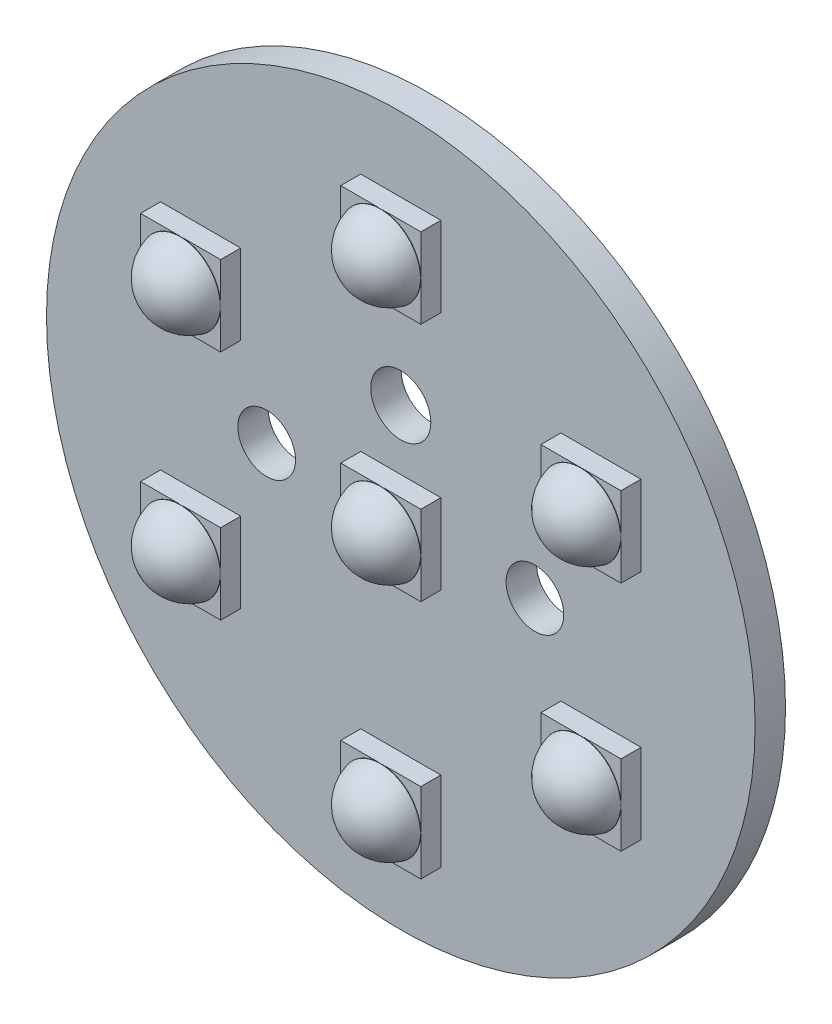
ISO-10303-21;
HEADER;
FILE_DESCRIPTION(('STEP AP214'),'2;1');
FILE_NAME('part.step','',(''),(''),'','','');
FILE_SCHEMA(('AUTOMOTIVE_DESIGN { 1 0 10303 214 1 1 1 1 }'));
ENDSEC;
DATA;
#1=APPLICATION_CONTEXT('core data for automotive mechanical design processes');
#2=APPLICATION_PROTOCOL_DEFINITION('international standard','automotive_design',2000,#1);
#3=PRODUCT_CONTEXT('',#1,'mechanical');
#4=PRODUCT('Part','Part','',(#3));
#5=PRODUCT_RELATED_PRODUCT_CATEGORY('part','',(#4));
#6=PRODUCT_DEFINITION_FORMATION('','',#4);
#7=PRODUCT_DEFINITION_CONTEXT('part definition',#1,'design');
#8=PRODUCT_DEFINITION('design','',#6,#7);
#9=PRODUCT_DEFINITION_SHAPE('','',#8);
#10=(LENGTH_UNIT() NAMED_UNIT(*) SI_UNIT(.MILLI.,.METRE.));
#11=(NAMED_UNIT(*) PLANE_ANGLE_UNIT() SI_UNIT($,.RADIAN.));
#12=(NAMED_UNIT(*) SI_UNIT($,.STERADIAN.) SOLID_ANGLE_UNIT());
#13=UNCERTAINTY_MEASURE_WITH_UNIT(LENGTH_MEASURE(1.E-05),#10,'distance_accuracy_value','');
#14=(GEOMETRIC_REPRESENTATION_CONTEXT(3) GLOBAL_UNCERTAINTY_ASSIGNED_CONTEXT((#13)) GLOBAL_UNIT_ASSIGNED_CONTEXT((#10,
#11,#12)) REPRESENTATION_CONTEXT('',''));
#15=CARTESIAN_POINT('',(0.,0.,0.));
#16=DIRECTION('',(0.,0.,1.));
#17=DIRECTION('',(1.,0.,0.));
#18=AXIS2_PLACEMENT_3D('',#15,#16,#17);
#19=CARTESIAN_POINT('',(0.,0.,3.2004));
#20=DIRECTION('',(0.,0.,1.));
#21=DIRECTION('',(1.,0.,0.));
#22=AXIS2_PLACEMENT_3D('',#19,#20,#21);
#23=PLANE('',#22);
#24=DIRECTION('',(0.,1.,0.));
#25=VECTOR('',#24,1.);
#26=CARTESIAN_POINT('',(-10.16,-9.906,3.2004));
#27=LINE('',#26,#25);
#28=CARTESIAN_POINT('',(-10.16,-9.906,3.2004));
#29=VERTEX_POINT('',#28);
#30=CARTESIAN_POINT('',(-10.16,-7.366,3.2004));
#31=VERTEX_POINT('',#30);
#32=EDGE_CURVE('E331',#29,#31,#27,.T.);
#33=ORIENTED_EDGE('',*,*,#32,.T.);
#34=CARTESIAN_POINT('',(-12.7,-7.366,3.2004));
#35=DIRECTION('',(0.,0.,1.));
#36=DIRECTION('',(1.,0.,0.));
#37=AXIS2_PLACEMENT_3D('',#34,#35,#36);
#38=CIRCLE('',#37,2.54);
#39=CARTESIAN_POINT('',(-12.7,-9.906,3.2004));
#40=VERTEX_POINT('',#39);
#41=EDGE_CURVE('E11',#31,#40,#38,.F.);
#42=ORIENTED_EDGE('',*,*,#41,.T.);
#43=DIRECTION('',(1.,0.,0.));
#44=VECTOR('',#43,1.);
#45=CARTESIAN_POINT('',(-15.24,-9.906,3.2004));
#46=LINE('',#45,#44);
#47=EDGE_CURVE('E352',#40,#29,#46,.T.);
#48=ORIENTED_EDGE('',*,*,#47,.T.);
#49=EDGE_LOOP('',(#33,#42,#48));
#50=FACE_BOUND('',#49,.T.);
#51=ADVANCED_FACE('F38',(#50),#23,.T.);
#52=CARTESIAN_POINT('',(-15.24,-9.906,3.2004));
#53=VERTEX_POINT('',#52);
#54=EDGE_CURVE('E1135',#53,#40,#46,.T.);
#55=ORIENTED_EDGE('',*,*,#54,.T.);
#56=CARTESIAN_POINT('',(-15.24,-7.366,3.2004));
#57=VERTEX_POINT('',#56);
#58=EDGE_CURVE('E48',#40,#57,#38,.F.);
#59=ORIENTED_EDGE('',*,*,#58,.T.);
#60=DIRECTION('',(0.,-1.,0.));
#61=VECTOR('',#60,1.);
#62=CARTESIAN_POINT('',(-15.24,-9.906,3.2004));
#63=LINE('',#62,#61);
#64=EDGE_CURVE('E336',#57,#53,#63,.T.);
#65=ORIENTED_EDGE('',*,*,#64,.T.);
#66=EDGE_LOOP('',(#55,#59,#65));
#67=FACE_BOUND('',#66,.T.);
#68=ADVANCED_FACE('F650',(#67),#23,.T.);
#69=CARTESIAN_POINT('',(-15.24,-4.826,3.2004));
#70=VERTEX_POINT('',#69);
#71=EDGE_CURVE('E322',#70,#57,#63,.T.);
#72=ORIENTED_EDGE('',*,*,#71,.T.);
#73=CARTESIAN_POINT('',(-12.7,-4.826,3.2004));
#74=VERTEX_POINT('',#73);
#75=EDGE_CURVE('E309',#57,#74,#38,.F.);
#76=ORIENTED_EDGE('',*,*,#75,.T.);
#77=DIRECTION('',(-1.,0.,0.));
#78=VECTOR('',#77,1.);
#79=CARTESIAN_POINT('',(-15.24,-4.826,3.2004));
#80=LINE('',#79,#78);
#81=EDGE_CURVE('E319',#74,#70,#80,.T.);
#82=ORIENTED_EDGE('',*,*,#81,.T.);
#83=EDGE_LOOP('',(#72,#76,#82));
#84=FACE_BOUND('',#83,.T.);
#85=ADVANCED_FACE('F318',(#84),#23,.T.);
#86=CARTESIAN_POINT('',(-10.16,-4.826,3.2004));
#87=VERTEX_POINT('',#86);
#88=EDGE_CURVE('E329',#87,#74,#80,.T.);
#89=ORIENTED_EDGE('',*,*,#88,.T.);
#90=EDGE_CURVE('E50',#74,#31,#38,.F.);
#91=ORIENTED_EDGE('',*,*,#90,.T.);
#92=EDGE_CURVE('E334',#31,#87,#27,.T.);
#93=ORIENTED_EDGE('',*,*,#92,.T.);
#94=EDGE_LOOP('',(#89,#91,#93));
#95=FACE_BOUND('',#94,.T.);
#96=ADVANCED_FACE('F333',(#95),#23,.T.);
#97=CARTESIAN_POINT('',(0.,0.,3.2004));
#98=DIRECTION('',(0.,0.,1.));
#99=DIRECTION('',(1.,0.,0.));
#100=AXIS2_PLACEMENT_3D('',#97,#98,#99);
#101=PLANE('',#100);
#102=DIRECTION('',(0.,1.,0.));
#103=VECTOR('',#102,1.);
#104=CARTESIAN_POINT('',(2.54,-17.78,3.2004));
#105=LINE('',#104,#103);
#106=CARTESIAN_POINT('',(2.54,-17.78,3.2004));
#107=VERTEX_POINT('',#106);
#108=CARTESIAN_POINT('',(2.54,-15.24,3.2004));
#109=VERTEX_POINT('',#108);
#110=EDGE_CURVE('E366',#107,#109,#105,.T.);
#111=ORIENTED_EDGE('',*,*,#110,.T.);
#112=CARTESIAN_POINT('',(0.,-15.24,3.2004));
#113=DIRECTION('',(0.,0.,1.));
#114=DIRECTION('',(1.,0.,0.));
#115=AXIS2_PLACEMENT_3D('',#112,#113,#114);
#116=CIRCLE('',#115,2.54);
#117=CARTESIAN_POINT('',(0.,-17.78,3.2004));
#118=VERTEX_POINT('',#117);
#119=EDGE_CURVE('E63',#109,#118,#116,.F.);
#120=ORIENTED_EDGE('',*,*,#119,.T.);
#121=DIRECTION('',(1.,0.,0.));
#122=VECTOR('',#121,1.);
#123=CARTESIAN_POINT('',(-2.54,-17.78,3.2004));
#124=LINE('',#123,#122);
#125=EDGE_CURVE('E365',#118,#107,#124,.T.);
#126=ORIENTED_EDGE('',*,*,#125,.T.);
#127=EDGE_LOOP('',(#111,#120,#126));
#128=FACE_BOUND('',#127,.T.);
#129=ADVANCED_FACE('F661',(#128),#101,.T.);
#130=CARTESIAN_POINT('',(-2.54,-17.78,3.2004));
#131=VERTEX_POINT('',#130);
#132=EDGE_CURVE('E361',#131,#118,#124,.T.);
#133=ORIENTED_EDGE('',*,*,#132,.T.);
#134=CARTESIAN_POINT('',(-2.54,-15.24,3.2004));
#135=VERTEX_POINT('',#134);
#136=EDGE_CURVE('E1158',#118,#135,#116,.F.);
#137=ORIENTED_EDGE('',*,*,#136,.T.);
#138=DIRECTION('',(0.,-1.,0.));
#139=VECTOR('',#138,1.);
#140=CARTESIAN_POINT('',(-2.54,-17.78,3.2004));
#141=LINE('',#140,#139);
#142=EDGE_CURVE('E373',#135,#131,#141,.T.);
#143=ORIENTED_EDGE('',*,*,#142,.T.);
#144=EDGE_LOOP('',(#133,#137,#143));
#145=FACE_BOUND('',#144,.T.);
#146=ADVANCED_FACE('F666',(#145),#101,.T.);
#147=CARTESIAN_POINT('',(-2.54,-12.7,3.2004));
#148=VERTEX_POINT('',#147);
#149=EDGE_CURVE('E374',#148,#135,#141,.T.);
#150=ORIENTED_EDGE('',*,*,#149,.T.);
#151=CARTESIAN_POINT('',(0.,-12.7,3.2004));
#152=VERTEX_POINT('',#151);
#153=EDGE_CURVE('E614',#135,#152,#116,.F.);
#154=ORIENTED_EDGE('',*,*,#153,.T.);
#155=DIRECTION('',(-1.,0.,0.));
#156=VECTOR('',#155,1.);
#157=CARTESIAN_POINT('',(-2.54,-12.7,3.2004));
#158=LINE('',#157,#156);
#159=EDGE_CURVE('E369',#152,#148,#158,.T.);
#160=ORIENTED_EDGE('',*,*,#159,.T.);
#161=EDGE_LOOP('',(#150,#154,#160));
#162=FACE_BOUND('',#161,.T.);
#163=ADVANCED_FACE('F1301',(#162),#101,.T.);
#164=CARTESIAN_POINT('',(2.54,-12.7,3.2004));
#165=VERTEX_POINT('',#164);
#166=EDGE_CURVE('E370',#165,#152,#158,.T.);
#167=ORIENTED_EDGE('',*,*,#166,.T.);
#168=EDGE_CURVE('E612',#152,#109,#116,.F.);
#169=ORIENTED_EDGE('',*,*,#168,.T.);
#170=EDGE_CURVE('E364',#109,#165,#105,.T.);
#171=ORIENTED_EDGE('',*,*,#170,.T.);
#172=EDGE_LOOP('',(#167,#169,#171));
#173=FACE_BOUND('',#172,.T.);
#174=ADVANCED_FACE('F669',(#173),#101,.T.);
#175=CARTESIAN_POINT('',(0.,0.,3.2004));
#176=DIRECTION('',(0.,0.,1.));
#177=DIRECTION('',(1.,0.,0.));
#178=AXIS2_PLACEMENT_3D('',#175,#176,#177);
#179=PLANE('',#178);
#180=DIRECTION('',(0.,1.,0.));
#181=VECTOR('',#180,1.);
#182=CARTESIAN_POINT('',(15.24,9.906,3.2004));
#183=LINE('',#182,#181);
#184=CARTESIAN_POINT('',(15.24,4.826,3.2004));
#185=VERTEX_POINT('',#184);
#186=CARTESIAN_POINT('',(15.24,7.366,3.2004));
#187=VERTEX_POINT('',#186);
#188=EDGE_CURVE('E550',#185,#187,#183,.T.);
#189=ORIENTED_EDGE('',*,*,#188,.T.);
#190=CARTESIAN_POINT('',(12.7,7.366,3.2004));
#191=DIRECTION('',(0.,0.,1.));
#192=DIRECTION('',(1.,0.,0.));
#193=AXIS2_PLACEMENT_3D('',#190,#191,#192);
#194=CIRCLE('',#193,2.54);
#195=CARTESIAN_POINT('',(12.7,4.826,3.2004));
#196=VERTEX_POINT('',#195);
#197=EDGE_CURVE('E611',#187,#196,#194,.F.);
#198=ORIENTED_EDGE('',*,*,#197,.T.);
#199=DIRECTION('',(1.,0.,0.));
#200=VECTOR('',#199,1.);
#201=CARTESIAN_POINT('',(10.16,4.826,3.2004));
#202=LINE('',#201,#200);
#203=EDGE_CURVE('E544',#196,#185,#202,.T.);
#204=ORIENTED_EDGE('',*,*,#203,.T.);
#205=EDGE_LOOP('',(#189,#198,#204));
#206=FACE_BOUND('',#205,.T.);
#207=ADVANCED_FACE('F1307',(#206),#179,.T.);
#208=CARTESIAN_POINT('',(10.16,4.826,3.2004));
#209=VERTEX_POINT('',#208);
#210=EDGE_CURVE('E546',#209,#196,#202,.T.);
#211=ORIENTED_EDGE('',*,*,#210,.T.);
#212=CARTESIAN_POINT('',(10.16,7.366,3.2004));
#213=VERTEX_POINT('',#212);
#214=EDGE_CURVE('E1172',#196,#213,#194,.F.);
#215=ORIENTED_EDGE('',*,*,#214,.T.);
#216=DIRECTION('',(0.,-1.,0.));
#217=VECTOR('',#216,1.);
#218=CARTESIAN_POINT('',(10.16,9.906,3.2004));
#219=LINE('',#218,#217);
#220=EDGE_CURVE('E545',#213,#209,#219,.T.);
#221=ORIENTED_EDGE('',*,*,#220,.T.);
#222=EDGE_LOOP('',(#211,#215,#221));
#223=FACE_BOUND('',#222,.T.);
#224=ADVANCED_FACE('F1330',(#223),#179,.T.);
#225=CARTESIAN_POINT('',(10.16,9.906,3.2004));
#226=VERTEX_POINT('',#225);
#227=EDGE_CURVE('E541',#226,#213,#219,.T.);
#228=ORIENTED_EDGE('',*,*,#227,.T.);
#229=CARTESIAN_POINT('',(12.7,9.906,3.2004));
#230=VERTEX_POINT('',#229);
#231=EDGE_CURVE('E610',#213,#230,#194,.F.);
#232=ORIENTED_EDGE('',*,*,#231,.T.);
#233=DIRECTION('',(-1.,0.,0.));
#234=VECTOR('',#233,1.);
#235=CARTESIAN_POINT('',(10.16,9.906,3.2004));
#236=LINE('',#235,#234);
#237=EDGE_CURVE('E553',#230,#226,#236,.T.);
#238=ORIENTED_EDGE('',*,*,#237,.T.);
#239=EDGE_LOOP('',(#228,#232,#238));
#240=FACE_BOUND('',#239,.T.);
#241=ADVANCED_FACE('F1335',(#240),#179,.T.);
#242=CARTESIAN_POINT('',(15.24,9.906,3.2004));
#243=VERTEX_POINT('',#242);
#244=EDGE_CURVE('E554',#243,#230,#236,.T.);
#245=ORIENTED_EDGE('',*,*,#244,.T.);
#246=EDGE_CURVE('E606',#230,#187,#194,.F.);
#247=ORIENTED_EDGE('',*,*,#246,.T.);
#248=EDGE_CURVE('E549',#187,#243,#183,.T.);
#249=ORIENTED_EDGE('',*,*,#248,.T.);
#250=EDGE_LOOP('',(#245,#247,#249));
#251=FACE_BOUND('',#250,.T.);
#252=ADVANCED_FACE('F1319',(#251),#179,.T.);
#253=CARTESIAN_POINT('',(0.,0.,3.2004));
#254=DIRECTION('',(0.,0.,1.));
#255=DIRECTION('',(1.,0.,0.));
#256=AXIS2_PLACEMENT_3D('',#253,#254,#255);
#257=PLANE('',#256);
#258=DIRECTION('',(0.,1.,0.));
#259=VECTOR('',#258,1.);
#260=CARTESIAN_POINT('',(2.54,2.54,3.2004));
#261=LINE('',#260,#259);
#262=CARTESIAN_POINT('',(2.54,-2.54,3.2004));
#263=VERTEX_POINT('',#262);
#264=CARTESIAN_POINT('',(2.54,0.,3.2004));
#265=VERTEX_POINT('',#264);
#266=EDGE_CURVE('E442',#263,#265,#261,.T.);
#267=ORIENTED_EDGE('',*,*,#266,.T.);
#268=CARTESIAN_POINT('',(0.,0.,3.2004));
#269=DIRECTION('',(0.,0.,1.));
#270=DIRECTION('',(1.,0.,0.));
#271=AXIS2_PLACEMENT_3D('',#268,#269,#270);
#272=CIRCLE('',#271,2.54);
#273=CARTESIAN_POINT('',(0.,-2.54,3.2004));
#274=VERTEX_POINT('',#273);
#275=EDGE_CURVE('E605',#265,#274,#272,.F.);
#276=ORIENTED_EDGE('',*,*,#275,.T.);
#277=DIRECTION('',(1.,0.,0.));
#278=VECTOR('',#277,1.);
#279=CARTESIAN_POINT('',(-2.54,-2.54,3.2004));
#280=LINE('',#279,#278);
#281=EDGE_CURVE('E436',#274,#263,#280,.T.);
#282=ORIENTED_EDGE('',*,*,#281,.T.);
#283=EDGE_LOOP('',(#267,#276,#282));
#284=FACE_BOUND('',#283,.T.);
#285=ADVANCED_FACE('F1316',(#284),#257,.T.);
#286=CARTESIAN_POINT('',(-2.54,-2.54,3.2004));
#287=VERTEX_POINT('',#286);
#288=EDGE_CURVE('E438',#287,#274,#280,.T.);
#289=ORIENTED_EDGE('',*,*,#288,.T.);
#290=CARTESIAN_POINT('',(-2.54,0.,3.2004));
#291=VERTEX_POINT('',#290);
#292=EDGE_CURVE('E1187',#274,#291,#272,.F.);
#293=ORIENTED_EDGE('',*,*,#292,.T.);
#294=DIRECTION('',(0.,-1.,0.));
#295=VECTOR('',#294,1.);
#296=CARTESIAN_POINT('',(-2.54,2.54,3.2004));
#297=LINE('',#296,#295);
#298=EDGE_CURVE('E437',#291,#287,#297,.T.);
#299=ORIENTED_EDGE('',*,*,#298,.T.);
#300=EDGE_LOOP('',(#289,#293,#299));
#301=FACE_BOUND('',#300,.T.);
#302=ADVANCED_FACE('F1318',(#301),#257,.T.);
#303=CARTESIAN_POINT('',(-2.54,2.54,3.2004));
#304=VERTEX_POINT('',#303);
#305=EDGE_CURVE('E433',#304,#291,#297,.T.);
#306=ORIENTED_EDGE('',*,*,#305,.T.);
#307=CARTESIAN_POINT('',(0.,2.54,3.2004));
#308=VERTEX_POINT('',#307);
#309=EDGE_CURVE('E604',#291,#308,#272,.F.);
#310=ORIENTED_EDGE('',*,*,#309,.T.);
#311=DIRECTION('',(-1.,0.,0.));
#312=VECTOR('',#311,1.);
#313=CARTESIAN_POINT('',(-2.54,2.54,3.2004));
#314=LINE('',#313,#312);
#315=EDGE_CURVE('E445',#308,#304,#314,.T.);
#316=ORIENTED_EDGE('',*,*,#315,.T.);
#317=EDGE_LOOP('',(#306,#310,#316));
#318=FACE_BOUND('',#317,.T.);
#319=ADVANCED_FACE('F1421',(#318),#257,.T.);
#320=CARTESIAN_POINT('',(2.54,2.54,3.2004));
#321=VERTEX_POINT('',#320);
#322=EDGE_CURVE('E446',#321,#308,#314,.T.);
#323=ORIENTED_EDGE('',*,*,#322,.T.);
#324=EDGE_CURVE('E600',#308,#265,#272,.F.);
#325=ORIENTED_EDGE('',*,*,#324,.T.);
#326=EDGE_CURVE('E441',#265,#321,#261,.T.);
#327=ORIENTED_EDGE('',*,*,#326,.T.);
#328=EDGE_LOOP('',(#323,#325,#327));
#329=FACE_BOUND('',#328,.T.);
#330=ADVANCED_FACE('F1321',(#329),#257,.T.);
#331=CARTESIAN_POINT('',(0.,0.,3.2004));
#332=DIRECTION('',(0.,0.,1.));
#333=DIRECTION('',(1.,0.,0.));
#334=AXIS2_PLACEMENT_3D('',#331,#332,#333);
#335=PLANE('',#334);
#336=DIRECTION('',(0.,1.,0.));
#337=VECTOR('',#336,1.);
#338=CARTESIAN_POINT('',(-10.16,9.906,3.2004));
#339=LINE('',#338,#337);
#340=CARTESIAN_POINT('',(-10.16,4.826,3.2004));
#341=VERTEX_POINT('',#340);
#342=CARTESIAN_POINT('',(-10.16,7.366,3.2004));
#343=VERTEX_POINT('',#342);
#344=EDGE_CURVE('E478',#341,#343,#339,.T.);
#345=ORIENTED_EDGE('',*,*,#344,.T.);
#346=CARTESIAN_POINT('',(-12.7,7.366,3.2004));
#347=DIRECTION('',(0.,0.,1.));
#348=DIRECTION('',(1.,0.,0.));
#349=AXIS2_PLACEMENT_3D('',#346,#347,#348);
#350=CIRCLE('',#349,2.54);
#351=CARTESIAN_POINT('',(-12.7,4.826,3.2004));
#352=VERTEX_POINT('',#351);
#353=EDGE_CURVE('E599',#343,#352,#350,.F.);
#354=ORIENTED_EDGE('',*,*,#353,.T.);
#355=DIRECTION('',(1.,0.,0.));
#356=VECTOR('',#355,1.);
#357=CARTESIAN_POINT('',(-15.24,4.826,3.2004));
#358=LINE('',#357,#356);
#359=EDGE_CURVE('E472',#352,#341,#358,.T.);
#360=ORIENTED_EDGE('',*,*,#359,.T.);
#361=EDGE_LOOP('',(#345,#354,#360));
#362=FACE_BOUND('',#361,.T.);
#363=ADVANCED_FACE('F1323',(#362),#335,.T.);
#364=CARTESIAN_POINT('',(-15.24,4.826,3.2004));
#365=VERTEX_POINT('',#364);
#366=EDGE_CURVE('E474',#365,#352,#358,.T.);
#367=ORIENTED_EDGE('',*,*,#366,.T.);
#368=CARTESIAN_POINT('',(-15.24,7.366,3.2004));
#369=VERTEX_POINT('',#368);
#370=EDGE_CURVE('E1202',#352,#369,#350,.F.);
#371=ORIENTED_EDGE('',*,*,#370,.T.);
#372=DIRECTION('',(0.,-1.,0.));
#373=VECTOR('',#372,1.);
#374=CARTESIAN_POINT('',(-15.24,9.906,3.2004));
#375=LINE('',#374,#373);
#376=EDGE_CURVE('E473',#369,#365,#375,.T.);
#377=ORIENTED_EDGE('',*,*,#376,.T.);
#378=EDGE_LOOP('',(#367,#371,#377));
#379=FACE_BOUND('',#378,.T.);
#380=ADVANCED_FACE('F1325',(#379),#335,.T.);
#381=CARTESIAN_POINT('',(-15.24,9.906,3.2004));
#382=VERTEX_POINT('',#381);
#383=EDGE_CURVE('E469',#382,#369,#375,.T.);
#384=ORIENTED_EDGE('',*,*,#383,.T.);
#385=CARTESIAN_POINT('',(-12.7,9.906,3.2004));
#386=VERTEX_POINT('',#385);
#387=EDGE_CURVE('E598',#369,#386,#350,.F.);
#388=ORIENTED_EDGE('',*,*,#387,.T.);
#389=DIRECTION('',(-1.,0.,0.));
#390=VECTOR('',#389,1.);
#391=CARTESIAN_POINT('',(-15.24,9.906,3.2004));
#392=LINE('',#391,#390);
#393=EDGE_CURVE('E481',#386,#382,#392,.T.);
#394=ORIENTED_EDGE('',*,*,#393,.T.);
#395=EDGE_LOOP('',(#384,#388,#394));
#396=FACE_BOUND('',#395,.T.);
#397=ADVANCED_FACE('F1448',(#396),#335,.T.);
#398=CARTESIAN_POINT('',(-10.16,9.906,3.2004));
#399=VERTEX_POINT('',#398);
#400=EDGE_CURVE('E482',#399,#386,#392,.T.);
#401=ORIENTED_EDGE('',*,*,#400,.T.);
#402=EDGE_CURVE('E594',#386,#343,#350,.F.);
#403=ORIENTED_EDGE('',*,*,#402,.T.);
#404=EDGE_CURVE('E477',#343,#399,#339,.T.);
#405=ORIENTED_EDGE('',*,*,#404,.T.);
#406=EDGE_LOOP('',(#401,#403,#405));
#407=FACE_BOUND('',#406,.T.);
#408=ADVANCED_FACE('F1312',(#407),#335,.T.);
#409=CARTESIAN_POINT('',(0.,0.,3.2004));
#410=DIRECTION('',(0.,0.,1.));
#411=DIRECTION('',(1.,0.,0.));
#412=AXIS2_PLACEMENT_3D('',#409,#410,#411);
#413=PLANE('',#412);
#414=DIRECTION('',(0.,1.,0.));
#415=VECTOR('',#414,1.);
#416=CARTESIAN_POINT('',(15.24,-9.906,3.2004));
#417=LINE('',#416,#415);
#418=CARTESIAN_POINT('',(15.24,-9.906,3.2004));
#419=VERTEX_POINT('',#418);
#420=CARTESIAN_POINT('',(15.24,-7.366,3.2004));
#421=VERTEX_POINT('',#420);
#422=EDGE_CURVE('E402',#419,#421,#417,.T.);
#423=ORIENTED_EDGE('',*,*,#422,.T.);
#424=CARTESIAN_POINT('',(12.7,-7.366,3.2004));
#425=DIRECTION('',(0.,0.,1.));
#426=DIRECTION('',(1.,0.,0.));
#427=AXIS2_PLACEMENT_3D('',#424,#425,#426);
#428=CIRCLE('',#427,2.54);
#429=CARTESIAN_POINT('',(12.7,-9.906,3.2004));
#430=VERTEX_POINT('',#429);
#431=EDGE_CURVE('E593',#421,#430,#428,.F.);
#432=ORIENTED_EDGE('',*,*,#431,.T.);
#433=DIRECTION('',(1.,0.,0.));
#434=VECTOR('',#433,1.);
#435=CARTESIAN_POINT('',(10.16,-9.906,3.2004));
#436=LINE('',#435,#434);
#437=EDGE_CURVE('E401',#430,#419,#436,.T.);
#438=ORIENTED_EDGE('',*,*,#437,.T.);
#439=EDGE_LOOP('',(#423,#432,#438));
#440=FACE_BOUND('',#439,.T.);
#441=ADVANCED_FACE('F1309',(#440),#413,.T.);
#442=CARTESIAN_POINT('',(10.16,-9.906,3.2004));
#443=VERTEX_POINT('',#442);
#444=EDGE_CURVE('E397',#443,#430,#436,.T.);
#445=ORIENTED_EDGE('',*,*,#444,.T.);
#446=CARTESIAN_POINT('',(10.16,-7.366,3.2004));
#447=VERTEX_POINT('',#446);
#448=EDGE_CURVE('E1217',#430,#447,#428,.F.);
#449=ORIENTED_EDGE('',*,*,#448,.T.);
#450=DIRECTION('',(0.,-1.,0.));
#451=VECTOR('',#450,1.);
#452=CARTESIAN_POINT('',(10.16,-9.906,3.2004));
#453=LINE('',#452,#451);
#454=EDGE_CURVE('E409',#447,#443,#453,.T.);
#455=ORIENTED_EDGE('',*,*,#454,.T.);
#456=EDGE_LOOP('',(#445,#449,#455));
#457=FACE_BOUND('',#456,.T.);
#458=ADVANCED_FACE('F1311',(#457),#413,.T.);
#459=CARTESIAN_POINT('',(10.16,-4.826,3.2004));
#460=VERTEX_POINT('',#459);
#461=EDGE_CURVE('E410',#460,#447,#453,.T.);
#462=ORIENTED_EDGE('',*,*,#461,.T.);
#463=CARTESIAN_POINT('',(12.7,-4.826,3.2004));
#464=VERTEX_POINT('',#463);
#465=EDGE_CURVE('E592',#447,#464,#428,.F.);
#466=ORIENTED_EDGE('',*,*,#465,.T.);
#467=DIRECTION('',(-1.,0.,0.));
#468=VECTOR('',#467,1.);
#469=CARTESIAN_POINT('',(10.16,-4.826,3.2004));
#470=LINE('',#469,#468);
#471=EDGE_CURVE('E405',#464,#460,#470,.T.);
#472=ORIENTED_EDGE('',*,*,#471,.T.);
#473=EDGE_LOOP('',(#462,#466,#472));
#474=FACE_BOUND('',#473,.T.);
#475=ADVANCED_FACE('F1475',(#474),#413,.T.);
#476=CARTESIAN_POINT('',(15.24,-4.826,3.2004));
#477=VERTEX_POINT('',#476);
#478=EDGE_CURVE('E406',#477,#464,#470,.T.);
#479=ORIENTED_EDGE('',*,*,#478,.T.);
#480=EDGE_CURVE('E588',#464,#421,#428,.F.);
#481=ORIENTED_EDGE('',*,*,#480,.T.);
#482=EDGE_CURVE('E400',#421,#477,#417,.T.);
#483=ORIENTED_EDGE('',*,*,#482,.T.);
#484=EDGE_LOOP('',(#479,#481,#483));
#485=FACE_BOUND('',#484,.T.);
#486=ADVANCED_FACE('F1314',(#485),#413,.T.);
#487=CARTESIAN_POINT('',(0.,0.,3.2004));
#488=DIRECTION('',(0.,0.,1.));
#489=DIRECTION('',(1.,0.,0.));
#490=AXIS2_PLACEMENT_3D('',#487,#488,#489);
#491=PLANE('',#490);
#492=DIRECTION('',(0.,1.,0.));
#493=VECTOR('',#492,1.);
#494=CARTESIAN_POINT('',(2.54,17.78,3.2004));
#495=LINE('',#494,#493);
#496=CARTESIAN_POINT('',(2.54,12.7,3.2004));
#497=VERTEX_POINT('',#496);
#498=CARTESIAN_POINT('',(2.54,15.24,3.2004));
#499=VERTEX_POINT('',#498);
#500=EDGE_CURVE('E514',#497,#499,#495,.T.);
#501=ORIENTED_EDGE('',*,*,#500,.T.);
#502=CARTESIAN_POINT('',(0.,15.24,3.2004));
#503=DIRECTION('',(0.,0.,1.));
#504=DIRECTION('',(1.,0.,0.));
#505=AXIS2_PLACEMENT_3D('',#502,#503,#504);
#506=CIRCLE('',#505,2.54);
#507=CARTESIAN_POINT('',(0.,12.7,3.2004));
#508=VERTEX_POINT('',#507);
#509=EDGE_CURVE('E587',#499,#508,#506,.F.);
#510=ORIENTED_EDGE('',*,*,#509,.T.);
#511=DIRECTION('',(1.,0.,0.));
#512=VECTOR('',#511,1.);
#513=CARTESIAN_POINT('',(-2.54,12.7,3.2004));
#514=LINE('',#513,#512);
#515=EDGE_CURVE('E508',#508,#497,#514,.T.);
#516=ORIENTED_EDGE('',*,*,#515,.T.);
#517=EDGE_LOOP('',(#501,#510,#516));
#518=FACE_BOUND('',#517,.T.);
#519=ADVANCED_FACE('F1092',(#518),#491,.T.);
#520=CARTESIAN_POINT('',(-2.54,12.7,3.2004));
#521=VERTEX_POINT('',#520);
#522=EDGE_CURVE('E510',#521,#508,#514,.T.);
#523=ORIENTED_EDGE('',*,*,#522,.T.);
#524=CARTESIAN_POINT('',(-2.54,15.24,3.2004));
#525=VERTEX_POINT('',#524);
#526=EDGE_CURVE('E1232',#508,#525,#506,.F.);
#527=ORIENTED_EDGE('',*,*,#526,.T.);
#528=DIRECTION('',(0.,-1.,0.));
#529=VECTOR('',#528,1.);
#530=CARTESIAN_POINT('',(-2.54,17.78,3.2004));
#531=LINE('',#530,#529);
#532=EDGE_CURVE('E509',#525,#521,#531,.T.);
#533=ORIENTED_EDGE('',*,*,#532,.T.);
#534=EDGE_LOOP('',(#523,#527,#533));
#535=FACE_BOUND('',#534,.T.);
#536=ADVANCED_FACE('F1253',(#535),#491,.T.);
#537=CARTESIAN_POINT('',(-2.54,17.78,3.2004));
#538=VERTEX_POINT('',#537);
#539=EDGE_CURVE('E505',#538,#525,#531,.T.);
#540=ORIENTED_EDGE('',*,*,#539,.T.);
#541=CARTESIAN_POINT('',(0.,17.78,3.2004));
#542=VERTEX_POINT('',#541);
#543=EDGE_CURVE('E586',#525,#542,#506,.F.);
#544=ORIENTED_EDGE('',*,*,#543,.T.);
#545=DIRECTION('',(-1.,0.,0.));
#546=VECTOR('',#545,1.);
#547=CARTESIAN_POINT('',(-2.54,17.78,3.2004));
#548=LINE('',#547,#546);
#549=EDGE_CURVE('E517',#542,#538,#548,.T.);
#550=ORIENTED_EDGE('',*,*,#549,.T.);
#551=EDGE_LOOP('',(#540,#544,#550));
#552=FACE_BOUND('',#551,.T.);
#553=ADVANCED_FACE('F1089',(#552),#491,.T.);
#554=CARTESIAN_POINT('',(2.54,17.78,3.2004));
#555=VERTEX_POINT('',#554);
#556=EDGE_CURVE('E518',#555,#542,#548,.T.);
#557=ORIENTED_EDGE('',*,*,#556,.T.);
#558=EDGE_CURVE('E580',#542,#499,#506,.F.);
#559=ORIENTED_EDGE('',*,*,#558,.T.);
#560=EDGE_CURVE('E513',#499,#555,#495,.T.);
#561=ORIENTED_EDGE('',*,*,#560,.T.);
#562=EDGE_LOOP('',(#557,#559,#561));
#563=FACE_BOUND('',#562,.T.);
#564=ADVANCED_FACE('F1025',(#563),#491,.T.);
#565=CARTESIAN_POINT('',(0.,0.,1.9304));
#566=DIRECTION('',(0.,0.,1.));
#567=DIRECTION('',(1.,0.,0.));
#568=AXIS2_PLACEMENT_3D('',#565,#566,#567);
#569=PLANE('',#568);
#570=CARTESIAN_POINT('',(0.,6.35,1.9304));
#571=DIRECTION('',(0.,0.,1.));
#572=DIRECTION('',(1.,0.,0.));
#573=AXIS2_PLACEMENT_3D('',#570,#571,#572);
#574=CIRCLE('',#573,1.905);
#575=CARTESIAN_POINT('',(1.905,6.35,1.9304));
#576=VERTEX_POINT('',#575);
#577=EDGE_CURVE('E1121',#576,#576,#574,.T.);
#578=ORIENTED_EDGE('',*,*,#577,.F.);
#579=EDGE_LOOP('',(#578));
#580=FACE_BOUND('',#579,.T.);
#581=CARTESIAN_POINT('',(8.509,0.,1.9304));
#582=DIRECTION('',(0.,0.,1.));
#583=DIRECTION('',(1.,0.,0.));
#584=AXIS2_PLACEMENT_3D('',#581,#582,#583);
#585=CIRCLE('',#584,1.8288);
#586=CARTESIAN_POINT('',(10.3378,0.,1.9304));
#587=VERTEX_POINT('',#586);
#588=EDGE_CURVE('E1123',#587,#587,#585,.T.);
#589=ORIENTED_EDGE('',*,*,#588,.F.);
#590=EDGE_LOOP('',(#589));
#591=FACE_BOUND('',#590,.T.);
#592=CARTESIAN_POINT('',(-8.509,0.,1.9304));
#593=DIRECTION('',(0.,0.,1.));
#594=DIRECTION('',(1.,0.,0.));
#595=AXIS2_PLACEMENT_3D('',#592,#593,#594);
#596=CIRCLE('',#595,1.8288);
#597=CARTESIAN_POINT('',(-6.6802,0.,1.9304));
#598=VERTEX_POINT('',#597);
#599=EDGE_CURVE('E1129',#598,#598,#596,.T.);
#600=ORIENTED_EDGE('',*,*,#599,.F.);
#601=EDGE_LOOP('',(#600));
#602=FACE_BOUND('',#601,.T.);
#603=CARTESIAN_POINT('',(0.,0.,1.9304));
#604=DIRECTION('',(0.,0.,1.));
#605=DIRECTION('',(1.,0.,0.));
#606=AXIS2_PLACEMENT_3D('',#603,#604,#605);
#607=CIRCLE('',#606,22.479);
#608=CARTESIAN_POINT('',(-22.479,0.,1.9304));
#609=VERTEX_POINT('',#608);
#610=EDGE_CURVE('E577',#609,#609,#607,.T.);
#611=ORIENTED_EDGE('',*,*,#610,.T.);
#612=EDGE_LOOP('',(#611));
#613=FACE_BOUND('',#612,.T.);
#614=DIRECTION('',(1.,0.,0.));
#615=VECTOR('',#614,1.);
#616=CARTESIAN_POINT('',(10.16,4.826,1.9304));
#617=LINE('',#616,#615);
#618=CARTESIAN_POINT('',(10.16,4.826,1.9304));
#619=VERTEX_POINT('',#618);
#620=CARTESIAN_POINT('',(15.24,4.826,1.9304));
#621=VERTEX_POINT('',#620);
#622=EDGE_CURVE('E560',#619,#621,#617,.T.);
#623=ORIENTED_EDGE('',*,*,#622,.F.);
#624=DIRECTION('',(0.,-1.,0.));
#625=VECTOR('',#624,1.);
#626=CARTESIAN_POINT('',(10.16,9.906,1.9304));
#627=LINE('',#626,#625);
#628=CARTESIAN_POINT('',(10.16,9.906,1.9304));
#629=VERTEX_POINT('',#628);
#630=EDGE_CURVE('E540',#629,#619,#627,.T.);
#631=ORIENTED_EDGE('',*,*,#630,.F.);
#632=DIRECTION('',(-1.,0.,0.));
#633=VECTOR('',#632,1.);
#634=CARTESIAN_POINT('',(10.16,9.906,1.9304));
#635=LINE('',#634,#633);
#636=CARTESIAN_POINT('',(15.24,9.906,1.9304));
#637=VERTEX_POINT('',#636);
#638=EDGE_CURVE('E565',#637,#629,#635,.T.);
#639=ORIENTED_EDGE('',*,*,#638,.F.);
#640=DIRECTION('',(0.,1.,0.));
#641=VECTOR('',#640,1.);
#642=CARTESIAN_POINT('',(15.24,9.906,1.9304));
#643=LINE('',#642,#641);
#644=EDGE_CURVE('E562',#621,#637,#643,.T.);
#645=ORIENTED_EDGE('',*,*,#644,.F.);
#646=EDGE_LOOP('',(#623,#631,#639,#645));
#647=FACE_BOUND('',#646,.T.);
#648=DIRECTION('',(1.,0.,0.));
#649=VECTOR('',#648,1.);
#650=CARTESIAN_POINT('',(-2.54,12.7,1.9304));
#651=LINE('',#650,#649);
#652=CARTESIAN_POINT('',(-2.54,12.7,1.9304));
#653=VERTEX_POINT('',#652);
#654=CARTESIAN_POINT('',(2.54,12.7,1.9304));
#655=VERTEX_POINT('',#654);
#656=EDGE_CURVE('E524',#653,#655,#651,.T.);
#657=ORIENTED_EDGE('',*,*,#656,.F.);
#658=DIRECTION('',(0.,-1.,0.));
#659=VECTOR('',#658,1.);
#660=CARTESIAN_POINT('',(-2.54,17.78,1.9304));
#661=LINE('',#660,#659);
#662=CARTESIAN_POINT('',(-2.54,17.78,1.9304));
#663=VERTEX_POINT('',#662);
#664=EDGE_CURVE('E504',#663,#653,#661,.T.);
#665=ORIENTED_EDGE('',*,*,#664,.F.);
#666=DIRECTION('',(-1.,0.,0.));
#667=VECTOR('',#666,1.);
#668=CARTESIAN_POINT('',(-2.54,17.78,1.9304));
#669=LINE('',#668,#667);
#670=CARTESIAN_POINT('',(2.54,17.78,1.9304));
#671=VERTEX_POINT('',#670);
#672=EDGE_CURVE('E529',#671,#663,#669,.T.);
#673=ORIENTED_EDGE('',*,*,#672,.F.);
#674=DIRECTION('',(0.,1.,0.));
#675=VECTOR('',#674,1.);
#676=CARTESIAN_POINT('',(2.54,17.78,1.9304));
#677=LINE('',#676,#675);
#678=EDGE_CURVE('E526',#655,#671,#677,.T.);
#679=ORIENTED_EDGE('',*,*,#678,.F.);
#680=EDGE_LOOP('',(#657,#665,#673,#679));
#681=FACE_BOUND('',#680,.T.);
#682=DIRECTION('',(1.,0.,0.));
#683=VECTOR('',#682,1.);
#684=CARTESIAN_POINT('',(-15.24,4.826,1.9304));
#685=LINE('',#684,#683);
#686=CARTESIAN_POINT('',(-15.24,4.826,1.9304));
#687=VERTEX_POINT('',#686);
#688=CARTESIAN_POINT('',(-10.16,4.826,1.9304));
#689=VERTEX_POINT('',#688);
#690=EDGE_CURVE('E488',#687,#689,#685,.T.);
#691=ORIENTED_EDGE('',*,*,#690,.F.);
#692=DIRECTION('',(0.,-1.,0.));
#693=VECTOR('',#692,1.);
#694=CARTESIAN_POINT('',(-15.24,9.906,1.9304));
#695=LINE('',#694,#693);
#696=CARTESIAN_POINT('',(-15.24,9.906,1.9304));
#697=VERTEX_POINT('',#696);
#698=EDGE_CURVE('E468',#697,#687,#695,.T.);
#699=ORIENTED_EDGE('',*,*,#698,.F.);
#700=DIRECTION('',(-1.,0.,0.));
#701=VECTOR('',#700,1.);
#702=CARTESIAN_POINT('',(-15.24,9.906,1.9304));
#703=LINE('',#702,#701);
#704=CARTESIAN_POINT('',(-10.16,9.906,1.9304));
#705=VERTEX_POINT('',#704);
#706=EDGE_CURVE('E493',#705,#697,#703,.T.);
#707=ORIENTED_EDGE('',*,*,#706,.F.);
#708=DIRECTION('',(0.,1.,0.));
#709=VECTOR('',#708,1.);
#710=CARTESIAN_POINT('',(-10.16,9.906,1.9304));
#711=LINE('',#710,#709);
#712=EDGE_CURVE('E490',#689,#705,#711,.T.);
#713=ORIENTED_EDGE('',*,*,#712,.F.);
#714=EDGE_LOOP('',(#691,#699,#707,#713));
#715=FACE_BOUND('',#714,.T.);
#716=DIRECTION('',(1.,0.,0.));
#717=VECTOR('',#716,1.);
#718=CARTESIAN_POINT('',(-2.54,-2.54,1.9304));
#719=LINE('',#718,#717);
#720=CARTESIAN_POINT('',(-2.54,-2.54,1.9304));
#721=VERTEX_POINT('',#720);
#722=CARTESIAN_POINT('',(2.54,-2.54,1.9304));
#723=VERTEX_POINT('',#722);
#724=EDGE_CURVE('E452',#721,#723,#719,.T.);
#725=ORIENTED_EDGE('',*,*,#724,.F.);
#726=DIRECTION('',(0.,-1.,0.));
#727=VECTOR('',#726,1.);
#728=CARTESIAN_POINT('',(-2.54,2.54,1.9304));
#729=LINE('',#728,#727);
#730=CARTESIAN_POINT('',(-2.54,2.54,1.9304));
#731=VERTEX_POINT('',#730);
#732=EDGE_CURVE('E432',#731,#721,#729,.T.);
#733=ORIENTED_EDGE('',*,*,#732,.F.);
#734=DIRECTION('',(-1.,0.,0.));
#735=VECTOR('',#734,1.);
#736=CARTESIAN_POINT('',(-2.54,2.54,1.9304));
#737=LINE('',#736,#735);
#738=CARTESIAN_POINT('',(2.54,2.54,1.9304));
#739=VERTEX_POINT('',#738);
#740=EDGE_CURVE('E457',#739,#731,#737,.T.);
#741=ORIENTED_EDGE('',*,*,#740,.F.);
#742=DIRECTION('',(0.,1.,0.));
#743=VECTOR('',#742,1.);
#744=CARTESIAN_POINT('',(2.54,2.54,1.9304));
#745=LINE('',#744,#743);
#746=EDGE_CURVE('E454',#723,#739,#745,.T.);
#747=ORIENTED_EDGE('',*,*,#746,.F.);
#748=EDGE_LOOP('',(#725,#733,#741,#747));
#749=FACE_BOUND('',#748,.T.);
#750=DIRECTION('',(0.,1.,0.));
#751=VECTOR('',#750,1.);
#752=CARTESIAN_POINT('',(15.24,-9.906,1.9304));
#753=LINE('',#752,#751);
#754=CARTESIAN_POINT('',(15.24,-9.906,1.9304));
#755=VERTEX_POINT('',#754);
#756=CARTESIAN_POINT('',(15.24,-4.826,1.9304));
#757=VERTEX_POINT('',#756);
#758=EDGE_CURVE('E416',#755,#757,#753,.T.);
#759=ORIENTED_EDGE('',*,*,#758,.F.);
#760=DIRECTION('',(1.,0.,0.));
#761=VECTOR('',#760,1.);
#762=CARTESIAN_POINT('',(10.16,-9.906,1.9304));
#763=LINE('',#762,#761);
#764=CARTESIAN_POINT('',(10.16,-9.906,1.9304));
#765=VERTEX_POINT('',#764);
#766=EDGE_CURVE('E396',#765,#755,#763,.T.);
#767=ORIENTED_EDGE('',*,*,#766,.F.);
#768=DIRECTION('',(0.,-1.,0.));
#769=VECTOR('',#768,1.);
#770=CARTESIAN_POINT('',(10.16,-9.906,1.9304));
#771=LINE('',#770,#769);
#772=CARTESIAN_POINT('',(10.16,-4.826,1.9304));
#773=VERTEX_POINT('',#772);
#774=EDGE_CURVE('E421',#773,#765,#771,.T.);
#775=ORIENTED_EDGE('',*,*,#774,.F.);
#776=DIRECTION('',(-1.,0.,0.));
#777=VECTOR('',#776,1.);
#778=CARTESIAN_POINT('',(10.16,-4.826,1.9304));
#779=LINE('',#778,#777);
#780=EDGE_CURVE('E418',#757,#773,#779,.T.);
#781=ORIENTED_EDGE('',*,*,#780,.F.);
#782=EDGE_LOOP('',(#759,#767,#775,#781));
#783=FACE_BOUND('',#782,.T.);
#784=DIRECTION('',(0.,1.,0.));
#785=VECTOR('',#784,1.);
#786=CARTESIAN_POINT('',(2.54,-17.78,1.9304));
#787=LINE('',#786,#785);
#788=CARTESIAN_POINT('',(2.54,-17.78,1.9304));
#789=VERTEX_POINT('',#788);
#790=CARTESIAN_POINT('',(2.54,-12.7,1.9304));
#791=VERTEX_POINT('',#790);
#792=EDGE_CURVE('E380',#789,#791,#787,.T.);
#793=ORIENTED_EDGE('',*,*,#792,.F.);
#794=DIRECTION('',(1.,0.,0.));
#795=VECTOR('',#794,1.);
#796=CARTESIAN_POINT('',(-2.54,-17.78,1.9304));
#797=LINE('',#796,#795);
#798=CARTESIAN_POINT('',(-2.54,-17.78,1.9304));
#799=VERTEX_POINT('',#798);
#800=EDGE_CURVE('E360',#799,#789,#797,.T.);
#801=ORIENTED_EDGE('',*,*,#800,.F.);
#802=DIRECTION('',(0.,-1.,0.));
#803=VECTOR('',#802,1.);
#804=CARTESIAN_POINT('',(-2.54,-17.78,1.9304));
#805=LINE('',#804,#803);
#806=CARTESIAN_POINT('',(-2.54,-12.7,1.9304));
#807=VERTEX_POINT('',#806);
#808=EDGE_CURVE('E385',#807,#799,#805,.T.);
#809=ORIENTED_EDGE('',*,*,#808,.F.);
#810=DIRECTION('',(-1.,0.,0.));
#811=VECTOR('',#810,1.);
#812=CARTESIAN_POINT('',(-2.54,-12.7,1.9304));
#813=LINE('',#812,#811);
#814=EDGE_CURVE('E382',#791,#807,#813,.T.);
#815=ORIENTED_EDGE('',*,*,#814,.F.);
#816=EDGE_LOOP('',(#793,#801,#809,#815));
#817=FACE_BOUND('',#816,.T.);
#818=DIRECTION('',(0.,1.,0.));
#819=VECTOR('',#818,1.);
#820=CARTESIAN_POINT('',(-10.16,-9.906,1.9304));
#821=LINE('',#820,#819);
#822=CARTESIAN_POINT('',(-10.16,-9.906,1.9304));
#823=VERTEX_POINT('',#822);
#824=CARTESIAN_POINT('',(-10.16,-4.826,1.9304));
#825=VERTEX_POINT('',#824);
#826=EDGE_CURVE('E345',#823,#825,#821,.T.);
#827=ORIENTED_EDGE('',*,*,#826,.F.);
#828=DIRECTION('',(1.,0.,0.));
#829=VECTOR('',#828,1.);
#830=CARTESIAN_POINT('',(-15.24,-9.906,1.9304));
#831=LINE('',#830,#829);
#832=CARTESIAN_POINT('',(-15.24,-9.906,1.9304));
#833=VERTEX_POINT('',#832);
#834=EDGE_CURVE('E342',#833,#823,#831,.T.);
#835=ORIENTED_EDGE('',*,*,#834,.F.);
#836=DIRECTION('',(0.,-1.,0.));
#837=VECTOR('',#836,1.);
#838=CARTESIAN_POINT('',(-15.24,-9.906,1.9304));
#839=LINE('',#838,#837);
#840=CARTESIAN_POINT('',(-15.24,-4.826,1.9304));
#841=VERTEX_POINT('',#840);
#842=EDGE_CURVE('E350',#841,#833,#839,.T.);
#843=ORIENTED_EDGE('',*,*,#842,.F.);
#844=DIRECTION('',(-1.,0.,0.));
#845=VECTOR('',#844,1.);
#846=CARTESIAN_POINT('',(-15.24,-4.826,1.9304));
#847=LINE('',#846,#845);
#848=EDGE_CURVE('E348',#825,#841,#847,.T.);
#849=ORIENTED_EDGE('',*,*,#848,.F.);
#850=EDGE_LOOP('',(#827,#835,#843,#849));
#851=FACE_BOUND('',#850,.T.);
#852=ADVANCED_FACE('F691',(#580,#591,#602,#613,#647,#681,#715,#749,#783,#817,#851),#569,.T.);
#853=CARTESIAN_POINT('',(0.,0.,1.9304));
#854=DIRECTION('',(0.,0.,-1.));
#855=DIRECTION('',(-1.,0.,0.));
#856=AXIS2_PLACEMENT_3D('',#853,#854,#855);
#857=CYLINDRICAL_SURFACE('',#856,22.479);
#858=CARTESIAN_POINT('',(0.,0.,0.));
#859=DIRECTION('',(0.,0.,1.));
#860=DIRECTION('',(1.,0.,0.));
#861=AXIS2_PLACEMENT_3D('',#858,#859,#860);
#862=CIRCLE('',#861,22.479);
#863=CARTESIAN_POINT('',(-22.479,0.,0.));
#864=VERTEX_POINT('',#863);
#865=EDGE_CURVE('E576',#864,#864,#862,.T.);
#866=CARTESIAN_POINT('',(-22.479,0.,1.9304));
#867=CARTESIAN_POINT('',(-22.479,0.,1.91029166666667));
#868=CARTESIAN_POINT('',(-22.479,0.,1.89018333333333));
#869=CARTESIAN_POINT('',(-22.479,0.,1.84996666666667));
#870=CARTESIAN_POINT('',(-22.479,0.,1.82985833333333));
#871=CARTESIAN_POINT('',(-22.479,0.,1.78964166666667));
#872=CARTESIAN_POINT('',(-22.479,0.,1.76953333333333));
#873=CARTESIAN_POINT('',(-22.479,0.,1.72931666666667));
#874=CARTESIAN_POINT('',(-22.479,0.,1.70920833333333));
#875=CARTESIAN_POINT('',(-22.479,0.,1.66899166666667));
#876=CARTESIAN_POINT('',(-22.479,0.,1.64888333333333));
#877=CARTESIAN_POINT('',(-22.479,0.,1.60866666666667));
#878=CARTESIAN_POINT('',(-22.479,0.,1.58855833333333));
#879=CARTESIAN_POINT('',(-22.479,0.,1.54834166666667));
#880=CARTESIAN_POINT('',(-22.479,0.,1.52823333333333));
#881=CARTESIAN_POINT('',(-22.479,0.,1.48801666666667));
#882=CARTESIAN_POINT('',(-22.479,0.,1.46790833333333));
#883=CARTESIAN_POINT('',(-22.479,0.,1.42769166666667));
#884=CARTESIAN_POINT('',(-22.479,0.,1.40758333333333));
#885=CARTESIAN_POINT('',(-22.479,0.,1.36736666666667));
#886=CARTESIAN_POINT('',(-22.479,0.,1.34725833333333));
#887=CARTESIAN_POINT('',(-22.479,0.,1.30704166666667));
#888=CARTESIAN_POINT('',(-22.479,0.,1.28693333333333));
#889=CARTESIAN_POINT('',(-22.479,0.,1.24671666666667));
#890=CARTESIAN_POINT('',(-22.479,0.,1.22660833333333));
#891=CARTESIAN_POINT('',(-22.479,0.,1.18639166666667));
#892=CARTESIAN_POINT('',(-22.479,0.,1.16628333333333));
#893=CARTESIAN_POINT('',(-22.479,0.,1.12606666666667));
#894=CARTESIAN_POINT('',(-22.479,0.,1.10595833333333));
#895=CARTESIAN_POINT('',(-22.479,0.,1.06574166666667));
#896=CARTESIAN_POINT('',(-22.479,0.,1.04563333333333));
#897=CARTESIAN_POINT('',(-22.479,0.,1.00541666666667));
#898=CARTESIAN_POINT('',(-22.479,0.,0.985308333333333));
#899=CARTESIAN_POINT('',(-22.479,0.,0.945091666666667));
#900=CARTESIAN_POINT('',(-22.479,0.,0.924983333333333));
#901=CARTESIAN_POINT('',(-22.479,0.,0.884766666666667));
#902=CARTESIAN_POINT('',(-22.479,0.,0.864658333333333));
#903=CARTESIAN_POINT('',(-22.479,0.,0.824441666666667));
#904=CARTESIAN_POINT('',(-22.479,0.,0.804333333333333));
#905=CARTESIAN_POINT('',(-22.479,0.,0.764116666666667));
#906=CARTESIAN_POINT('',(-22.479,0.,0.744008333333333));
#907=CARTESIAN_POINT('',(-22.479,0.,0.703791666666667));
#908=CARTESIAN_POINT('',(-22.479,0.,0.683683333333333));
#909=CARTESIAN_POINT('',(-22.479,0.,0.643466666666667));
#910=CARTESIAN_POINT('',(-22.479,0.,0.623358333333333));
#911=CARTESIAN_POINT('',(-22.479,0.,0.583141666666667));
#912=CARTESIAN_POINT('',(-22.479,0.,0.563033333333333));
#913=CARTESIAN_POINT('',(-22.479,0.,0.522816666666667));
#914=CARTESIAN_POINT('',(-22.479,0.,0.502708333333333));
#915=CARTESIAN_POINT('',(-22.479,0.,0.462491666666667));
#916=CARTESIAN_POINT('',(-22.479,0.,0.442383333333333));
#917=CARTESIAN_POINT('',(-22.479,0.,0.402166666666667));
#918=CARTESIAN_POINT('',(-22.479,0.,0.382058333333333));
#919=CARTESIAN_POINT('',(-22.479,0.,0.341841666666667));
#920=CARTESIAN_POINT('',(-22.479,0.,0.321733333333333));
#921=CARTESIAN_POINT('',(-22.479,0.,0.281516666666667));
#922=CARTESIAN_POINT('',(-22.479,0.,0.261408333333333));
#923=CARTESIAN_POINT('',(-22.479,0.,0.221191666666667));
#924=CARTESIAN_POINT('',(-22.479,0.,0.201083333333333));
#925=CARTESIAN_POINT('',(-22.479,0.,0.160866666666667));
#926=CARTESIAN_POINT('',(-22.479,0.,0.140758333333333));
#927=CARTESIAN_POINT('',(-22.479,0.,0.100541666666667));
#928=CARTESIAN_POINT('',(-22.479,0.,0.0804333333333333));
#929=CARTESIAN_POINT('',(-22.479,0.,0.0402166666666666));
#930=CARTESIAN_POINT('',(-22.479,0.,0.0201083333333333));
#931=CARTESIAN_POINT('',(-22.479,0.,0.));
#932=B_SPLINE_CURVE_WITH_KNOTS('',3,(#866,#867,#868,#869,#870,#871,#872,#873,#874,#875,#876,
#877,#878,#879,#880,#881,#882,#883,#884,#885,#886,#887,#888,#889,#890,#891,#892,#893,#894,#895,
#896,#897,#898,#899,#900,#901,#902,#903,#904,#905,#906,#907,#908,#909,#910,#911,#912,#913,#914,
#915,#916,#917,#918,#919,#920,#921,#922,#923,#924,#925,#926,#927,#928,#929,#930,#931),
.UNSPECIFIED.,.F.,.F.,(4,2,2,2,2,2,2,2,2,2,2,2,2,2,2,2,2,2,2,2,2,2,2,2,2,2,2,2,2,2,2,2,4),(0.,
0.0603250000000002,0.12065,0.180975,0.2413,0.301625,0.36195,0.422275,0.4826,0.542925,0.60325,
0.663575,0.7239,0.784225,0.84455,0.904875,0.9652,1.025525,1.08585,1.146175,1.2065,1.266825,
1.32715,1.387475,1.4478,1.508125,1.56845,1.628775,1.6891,1.749425,1.80975,1.870075,1.9304),.UNSPECIFIED.);
#933=EDGE_CURVE('BSEAM686',#609,#864,#932,.T.);
#934=ORIENTED_EDGE('',*,*,#610,.F.);
#935=ORIENTED_EDGE('',*,*,#865,.T.);
#936=ORIENTED_EDGE('',*,*,#933,.T.);
#937=ORIENTED_EDGE('',*,*,#933,.F.);
#938=EDGE_LOOP('',(#934,#936,#935,#937));
#939=FACE_BOUND('',#938,.T.);
#940=ADVANCED_FACE('F686',(#939),#857,.T.);
#941=CARTESIAN_POINT('',(0.,0.,0.));
#942=DIRECTION('',(0.,0.,1.));
#943=DIRECTION('',(1.,0.,0.));
#944=AXIS2_PLACEMENT_3D('',#941,#942,#943);
#945=PLANE('',#944);
#946=CARTESIAN_POINT('',(0.,6.35,0.));
#947=DIRECTION('',(0.,0.,1.));
#948=DIRECTION('',(1.,0.,0.));
#949=AXIS2_PLACEMENT_3D('',#946,#947,#948);
#950=CIRCLE('',#949,1.905);
#951=CARTESIAN_POINT('',(1.905,6.35,0.));
#952=VERTEX_POINT('',#951);
#953=EDGE_CURVE('E1119',#952,#952,#950,.T.);
#954=ORIENTED_EDGE('',*,*,#953,.T.);
#955=EDGE_LOOP('',(#954));
#956=FACE_BOUND('',#955,.T.);
#957=CARTESIAN_POINT('',(8.509,0.,0.));
#958=DIRECTION('',(0.,0.,1.));
#959=DIRECTION('',(1.,0.,0.));
#960=AXIS2_PLACEMENT_3D('',#957,#958,#959);
#961=CIRCLE('',#960,1.8288);
#962=CARTESIAN_POINT('',(10.3378,0.,0.));
#963=VERTEX_POINT('',#962);
#964=EDGE_CURVE('E1126',#963,#963,#961,.T.);
#965=ORIENTED_EDGE('',*,*,#964,.T.);
#966=EDGE_LOOP('',(#965));
#967=FACE_BOUND('',#966,.T.);
#968=CARTESIAN_POINT('',(-8.509,0.,0.));
#969=DIRECTION('',(0.,0.,1.));
#970=DIRECTION('',(1.,0.,0.));
#971=AXIS2_PLACEMENT_3D('',#968,#969,#970);
#972=CIRCLE('',#971,1.8288);
#973=CARTESIAN_POINT('',(-6.6802,0.,0.));
#974=VERTEX_POINT('',#973);
#975=EDGE_CURVE('E630',#974,#974,#972,.T.);
#976=ORIENTED_EDGE('',*,*,#975,.T.);
#977=EDGE_LOOP('',(#976));
#978=FACE_BOUND('',#977,.T.);
#979=ORIENTED_EDGE('',*,*,#865,.F.);
#980=EDGE_LOOP('',(#979));
#981=FACE_BOUND('',#980,.T.);
#982=ADVANCED_FACE('F690',(#956,#967,#978,#981),#945,.F.);
#983=CARTESIAN_POINT('',(10.16,9.906,3.2004));
#984=DIRECTION('',(1.,0.,0.));
#985=DIRECTION('',(0.,0.,-1.));
#986=AXIS2_PLACEMENT_3D('',#983,#984,#985);
#987=PLANE('',#986);
#988=ORIENTED_EDGE('',*,*,#630,.T.);
#989=DIRECTION('',(0.,0.,-1.));
#990=VECTOR('',#989,1.);
#991=CARTESIAN_POINT('',(10.16,4.826,3.2004));
#992=LINE('',#991,#990);
#993=EDGE_CURVE('E574',#209,#619,#992,.T.);
#994=ORIENTED_EDGE('',*,*,#993,.F.);
#995=ORIENTED_EDGE('',*,*,#220,.F.);
#996=ORIENTED_EDGE('',*,*,#227,.F.);
#997=DIRECTION('',(0.,0.,-1.));
#998=VECTOR('',#997,1.);
#999=CARTESIAN_POINT('',(10.16,9.906,3.2004));
#1000=LINE('',#999,#998);
#1001=EDGE_CURVE('E557',#226,#629,#1000,.T.);
#1002=ORIENTED_EDGE('',*,*,#1001,.T.);
#1003=EDGE_LOOP('',(#988,#994,#995,#996,#1002));
#1004=FACE_BOUND('',#1003,.T.);
#1005=ADVANCED_FACE('F706',(#1004),#987,.F.);
#1006=CARTESIAN_POINT('',(10.16,4.826,3.2004));
#1007=DIRECTION('',(0.,1.,0.));
#1008=DIRECTION('',(0.,0.,1.));
#1009=AXIS2_PLACEMENT_3D('',#1006,#1007,#1008);
#1010=PLANE('',#1009);
#1011=ORIENTED_EDGE('',*,*,#622,.T.);
#1012=DIRECTION('',(0.,0.,-1.));
#1013=VECTOR('',#1012,1.);
#1014=CARTESIAN_POINT('',(15.24,4.826,3.2004));
#1015=LINE('',#1014,#1013);
#1016=EDGE_CURVE('E571',#185,#621,#1015,.T.);
#1017=ORIENTED_EDGE('',*,*,#1016,.F.);
#1018=ORIENTED_EDGE('',*,*,#203,.F.);
#1019=ORIENTED_EDGE('',*,*,#210,.F.);
#1020=ORIENTED_EDGE('',*,*,#993,.T.);
#1021=EDGE_LOOP('',(#1011,#1017,#1018,#1019,#1020));
#1022=FACE_BOUND('',#1021,.T.);
#1023=ADVANCED_FACE('F715',(#1022),#1010,.F.);
#1024=CARTESIAN_POINT('',(15.24,9.906,3.2004));
#1025=DIRECTION('',(-1.,0.,0.));
#1026=DIRECTION('',(0.,0.,1.));
#1027=AXIS2_PLACEMENT_3D('',#1024,#1025,#1026);
#1028=PLANE('',#1027);
#1029=ORIENTED_EDGE('',*,*,#644,.T.);
#1030=DIRECTION('',(0.,0.,-1.));
#1031=VECTOR('',#1030,1.);
#1032=CARTESIAN_POINT('',(15.24,9.906,3.2004));
#1033=LINE('',#1032,#1031);
#1034=EDGE_CURVE('E569',#243,#637,#1033,.T.);
#1035=ORIENTED_EDGE('',*,*,#1034,.F.);
#1036=ORIENTED_EDGE('',*,*,#248,.F.);
#1037=ORIENTED_EDGE('',*,*,#188,.F.);
#1038=ORIENTED_EDGE('',*,*,#1016,.T.);
#1039=EDGE_LOOP('',(#1029,#1035,#1036,#1037,#1038));
#1040=FACE_BOUND('',#1039,.T.);
#1041=ADVANCED_FACE('F724',(#1040),#1028,.F.);
#1042=CARTESIAN_POINT('',(10.16,9.906,3.2004));
#1043=DIRECTION('',(0.,-1.,0.));
#1044=DIRECTION('',(0.,0.,-1.));
#1045=AXIS2_PLACEMENT_3D('',#1042,#1043,#1044);
#1046=PLANE('',#1045);
#1047=ORIENTED_EDGE('',*,*,#638,.T.);
#1048=ORIENTED_EDGE('',*,*,#1001,.F.);
#1049=ORIENTED_EDGE('',*,*,#237,.F.);
#1050=ORIENTED_EDGE('',*,*,#244,.F.);
#1051=ORIENTED_EDGE('',*,*,#1034,.T.);
#1052=EDGE_LOOP('',(#1047,#1048,#1049,#1050,#1051));
#1053=FACE_BOUND('',#1052,.T.);
#1054=ADVANCED_FACE('F732',(#1053),#1046,.F.);
#1055=CARTESIAN_POINT('',(-2.54,17.78,3.2004));
#1056=DIRECTION('',(1.,0.,0.));
#1057=DIRECTION('',(0.,1.,0.));
#1058=AXIS2_PLACEMENT_3D('',#1055,#1056,#1057);
#1059=PLANE('',#1058);
#1060=ORIENTED_EDGE('',*,*,#664,.T.);
#1061=DIRECTION('',(0.,0.,-1.));
#1062=VECTOR('',#1061,1.);
#1063=CARTESIAN_POINT('',(-2.54,12.7,3.2004));
#1064=LINE('',#1063,#1062);
#1065=EDGE_CURVE('E538',#521,#653,#1064,.T.);
#1066=ORIENTED_EDGE('',*,*,#1065,.F.);
#1067=ORIENTED_EDGE('',*,*,#532,.F.);
#1068=ORIENTED_EDGE('',*,*,#539,.F.);
#1069=DIRECTION('',(0.,0.,-1.));
#1070=VECTOR('',#1069,1.);
#1071=CARTESIAN_POINT('',(-2.54,17.78,3.2004));
#1072=LINE('',#1071,#1070);
#1073=EDGE_CURVE('E521',#538,#663,#1072,.T.);
#1074=ORIENTED_EDGE('',*,*,#1073,.T.);
#1075=EDGE_LOOP('',(#1060,#1066,#1067,#1068,#1074));
#1076=FACE_BOUND('',#1075,.T.);
#1077=ADVANCED_FACE('F740',(#1076),#1059,.F.);
#1078=CARTESIAN_POINT('',(-2.54,12.7,3.2004));
#1079=DIRECTION('',(0.,1.,0.));
#1080=DIRECTION('',(-1.,0.,0.));
#1081=AXIS2_PLACEMENT_3D('',#1078,#1079,#1080);
#1082=PLANE('',#1081);
#1083=ORIENTED_EDGE('',*,*,#656,.T.);
#1084=DIRECTION('',(0.,0.,-1.));
#1085=VECTOR('',#1084,1.);
#1086=CARTESIAN_POINT('',(2.54,12.7,3.2004));
#1087=LINE('',#1086,#1085);
#1088=EDGE_CURVE('E535',#497,#655,#1087,.T.);
#1089=ORIENTED_EDGE('',*,*,#1088,.F.);
#1090=ORIENTED_EDGE('',*,*,#515,.F.);
#1091=ORIENTED_EDGE('',*,*,#522,.F.);
#1092=ORIENTED_EDGE('',*,*,#1065,.T.);
#1093=EDGE_LOOP('',(#1083,#1089,#1090,#1091,#1092));
#1094=FACE_BOUND('',#1093,.T.);
#1095=ADVANCED_FACE('F748',(#1094),#1082,.F.);
#1096=CARTESIAN_POINT('',(2.54,17.78,3.2004));
#1097=DIRECTION('',(-1.,0.,0.));
#1098=DIRECTION('',(0.,-1.,0.));
#1099=AXIS2_PLACEMENT_3D('',#1096,#1097,#1098);
#1100=PLANE('',#1099);
#1101=ORIENTED_EDGE('',*,*,#678,.T.);
#1102=DIRECTION('',(0.,0.,-1.));
#1103=VECTOR('',#1102,1.);
#1104=CARTESIAN_POINT('',(2.54,17.78,3.2004));
#1105=LINE('',#1104,#1103);
#1106=EDGE_CURVE('E533',#555,#671,#1105,.T.);
#1107=ORIENTED_EDGE('',*,*,#1106,.F.);
#1108=ORIENTED_EDGE('',*,*,#560,.F.);
#1109=ORIENTED_EDGE('',*,*,#500,.F.);
#1110=ORIENTED_EDGE('',*,*,#1088,.T.);
#1111=EDGE_LOOP('',(#1101,#1107,#1108,#1109,#1110));
#1112=FACE_BOUND('',#1111,.T.);
#1113=ADVANCED_FACE('F756',(#1112),#1100,.F.);
#1114=CARTESIAN_POINT('',(-2.54,17.78,3.2004));
#1115=DIRECTION('',(0.,-1.,0.));
#1116=DIRECTION('',(1.,0.,0.));
#1117=AXIS2_PLACEMENT_3D('',#1114,#1115,#1116);
#1118=PLANE('',#1117);
#1119=ORIENTED_EDGE('',*,*,#672,.T.);
#1120=ORIENTED_EDGE('',*,*,#1073,.F.);
#1121=ORIENTED_EDGE('',*,*,#549,.F.);
#1122=ORIENTED_EDGE('',*,*,#556,.F.);
#1123=ORIENTED_EDGE('',*,*,#1106,.T.);
#1124=EDGE_LOOP('',(#1119,#1120,#1121,#1122,#1123));
#1125=FACE_BOUND('',#1124,.T.);
#1126=ADVANCED_FACE('F764',(#1125),#1118,.F.);
#1127=CARTESIAN_POINT('',(-15.24,9.906,3.2004));
#1128=DIRECTION('',(1.,0.,0.));
#1129=DIRECTION('',(0.,0.,-1.));
#1130=AXIS2_PLACEMENT_3D('',#1127,#1128,#1129);
#1131=PLANE('',#1130);
#1132=ORIENTED_EDGE('',*,*,#698,.T.);
#1133=DIRECTION('',(0.,0.,-1.));
#1134=VECTOR('',#1133,1.);
#1135=CARTESIAN_POINT('',(-15.24,4.826,3.2004));
#1136=LINE('',#1135,#1134);
#1137=EDGE_CURVE('E502',#365,#687,#1136,.T.);
#1138=ORIENTED_EDGE('',*,*,#1137,.F.);
#1139=ORIENTED_EDGE('',*,*,#376,.F.);
#1140=ORIENTED_EDGE('',*,*,#383,.F.);
#1141=DIRECTION('',(0.,0.,-1.));
#1142=VECTOR('',#1141,1.);
#1143=CARTESIAN_POINT('',(-15.24,9.906,3.2004));
#1144=LINE('',#1143,#1142);
#1145=EDGE_CURVE('E485',#382,#697,#1144,.T.);
#1146=ORIENTED_EDGE('',*,*,#1145,.T.);
#1147=EDGE_LOOP('',(#1132,#1138,#1139,#1140,#1146));
#1148=FACE_BOUND('',#1147,.T.);
#1149=ADVANCED_FACE('F772',(#1148),#1131,.F.);
#1150=CARTESIAN_POINT('',(-15.24,4.826,3.2004));
#1151=DIRECTION('',(0.,1.,0.));
#1152=DIRECTION('',(0.,0.,1.));
#1153=AXIS2_PLACEMENT_3D('',#1150,#1151,#1152);
#1154=PLANE('',#1153);
#1155=ORIENTED_EDGE('',*,*,#690,.T.);
#1156=DIRECTION('',(0.,0.,-1.));
#1157=VECTOR('',#1156,1.);
#1158=CARTESIAN_POINT('',(-10.16,4.826,3.2004));
#1159=LINE('',#1158,#1157);
#1160=EDGE_CURVE('E499',#341,#689,#1159,.T.);
#1161=ORIENTED_EDGE('',*,*,#1160,.F.);
#1162=ORIENTED_EDGE('',*,*,#359,.F.);
#1163=ORIENTED_EDGE('',*,*,#366,.F.);
#1164=ORIENTED_EDGE('',*,*,#1137,.T.);
#1165=EDGE_LOOP('',(#1155,#1161,#1162,#1163,#1164));
#1166=FACE_BOUND('',#1165,.T.);
#1167=ADVANCED_FACE('F780',(#1166),#1154,.F.);
#1168=CARTESIAN_POINT('',(-10.16,9.906,3.2004));
#1169=DIRECTION('',(-1.,0.,0.));
#1170=DIRECTION('',(0.,-1.,0.));
#1171=AXIS2_PLACEMENT_3D('',#1168,#1169,#1170);
#1172=PLANE('',#1171);
#1173=ORIENTED_EDGE('',*,*,#712,.T.);
#1174=DIRECTION('',(0.,0.,-1.));
#1175=VECTOR('',#1174,1.);
#1176=CARTESIAN_POINT('',(-10.16,9.906,3.2004));
#1177=LINE('',#1176,#1175);
#1178=EDGE_CURVE('E497',#399,#705,#1177,.T.);
#1179=ORIENTED_EDGE('',*,*,#1178,.F.);
#1180=ORIENTED_EDGE('',*,*,#404,.F.);
#1181=ORIENTED_EDGE('',*,*,#344,.F.);
#1182=ORIENTED_EDGE('',*,*,#1160,.T.);
#1183=EDGE_LOOP('',(#1173,#1179,#1180,#1181,#1182));
#1184=FACE_BOUND('',#1183,.T.);
#1185=ADVANCED_FACE('F788',(#1184),#1172,.F.);
#1186=CARTESIAN_POINT('',(-15.24,9.906,3.2004));
#1187=DIRECTION('',(0.,-1.,0.));
#1188=DIRECTION('',(0.,0.,-1.));
#1189=AXIS2_PLACEMENT_3D('',#1186,#1187,#1188);
#1190=PLANE('',#1189);
#1191=ORIENTED_EDGE('',*,*,#706,.T.);
#1192=ORIENTED_EDGE('',*,*,#1145,.F.);
#1193=ORIENTED_EDGE('',*,*,#393,.F.);
#1194=ORIENTED_EDGE('',*,*,#400,.F.);
#1195=ORIENTED_EDGE('',*,*,#1178,.T.);
#1196=EDGE_LOOP('',(#1191,#1192,#1193,#1194,#1195));
#1197=FACE_BOUND('',#1196,.T.);
#1198=ADVANCED_FACE('F796',(#1197),#1190,.F.);
#1199=CARTESIAN_POINT('',(-2.54,2.54,3.2004));
#1200=DIRECTION('',(1.,0.,0.));
#1201=DIRECTION('',(0.,1.,0.));
#1202=AXIS2_PLACEMENT_3D('',#1199,#1200,#1201);
#1203=PLANE('',#1202);
#1204=ORIENTED_EDGE('',*,*,#732,.T.);
#1205=DIRECTION('',(0.,0.,-1.));
#1206=VECTOR('',#1205,1.);
#1207=CARTESIAN_POINT('',(-2.54,-2.54,3.2004));
#1208=LINE('',#1207,#1206);
#1209=EDGE_CURVE('E466',#287,#721,#1208,.T.);
#1210=ORIENTED_EDGE('',*,*,#1209,.F.);
#1211=ORIENTED_EDGE('',*,*,#298,.F.);
#1212=ORIENTED_EDGE('',*,*,#305,.F.);
#1213=DIRECTION('',(0.,0.,-1.));
#1214=VECTOR('',#1213,1.);
#1215=CARTESIAN_POINT('',(-2.54,2.54,3.2004));
#1216=LINE('',#1215,#1214);
#1217=EDGE_CURVE('E449',#304,#731,#1216,.T.);
#1218=ORIENTED_EDGE('',*,*,#1217,.T.);
#1219=EDGE_LOOP('',(#1204,#1210,#1211,#1212,#1218));
#1220=FACE_BOUND('',#1219,.T.);
#1221=ADVANCED_FACE('F804',(#1220),#1203,.F.);
#1222=CARTESIAN_POINT('',(-2.54,-2.54,3.2004));
#1223=DIRECTION('',(0.,1.,0.));
#1224=DIRECTION('',(-1.,0.,0.));
#1225=AXIS2_PLACEMENT_3D('',#1222,#1223,#1224);
#1226=PLANE('',#1225);
#1227=ORIENTED_EDGE('',*,*,#724,.T.);
#1228=DIRECTION('',(0.,0.,-1.));
#1229=VECTOR('',#1228,1.);
#1230=CARTESIAN_POINT('',(2.54,-2.54,3.2004));
#1231=LINE('',#1230,#1229);
#1232=EDGE_CURVE('E463',#263,#723,#1231,.T.);
#1233=ORIENTED_EDGE('',*,*,#1232,.F.);
#1234=ORIENTED_EDGE('',*,*,#281,.F.);
#1235=ORIENTED_EDGE('',*,*,#288,.F.);
#1236=ORIENTED_EDGE('',*,*,#1209,.T.);
#1237=EDGE_LOOP('',(#1227,#1233,#1234,#1235,#1236));
#1238=FACE_BOUND('',#1237,.T.);
#1239=ADVANCED_FACE('F812',(#1238),#1226,.F.);
#1240=CARTESIAN_POINT('',(2.54,2.54,3.2004));
#1241=DIRECTION('',(-1.,0.,0.));
#1242=DIRECTION('',(0.,-1.,0.));
#1243=AXIS2_PLACEMENT_3D('',#1240,#1241,#1242);
#1244=PLANE('',#1243);
#1245=ORIENTED_EDGE('',*,*,#746,.T.);
#1246=DIRECTION('',(0.,0.,-1.));
#1247=VECTOR('',#1246,1.);
#1248=CARTESIAN_POINT('',(2.54,2.54,3.2004));
#1249=LINE('',#1248,#1247);
#1250=EDGE_CURVE('E461',#321,#739,#1249,.T.);
#1251=ORIENTED_EDGE('',*,*,#1250,.F.);
#1252=ORIENTED_EDGE('',*,*,#326,.F.);
#1253=ORIENTED_EDGE('',*,*,#266,.F.);
#1254=ORIENTED_EDGE('',*,*,#1232,.T.);
#1255=EDGE_LOOP('',(#1245,#1251,#1252,#1253,#1254));
#1256=FACE_BOUND('',#1255,.T.);
#1257=ADVANCED_FACE('F820',(#1256),#1244,.F.);
#1258=CARTESIAN_POINT('',(-2.54,2.54,3.2004));
#1259=DIRECTION('',(0.,-1.,0.));
#1260=DIRECTION('',(1.,0.,0.));
#1261=AXIS2_PLACEMENT_3D('',#1258,#1259,#1260);
#1262=PLANE('',#1261);
#1263=ORIENTED_EDGE('',*,*,#740,.T.);
#1264=ORIENTED_EDGE('',*,*,#1217,.F.);
#1265=ORIENTED_EDGE('',*,*,#315,.F.);
#1266=ORIENTED_EDGE('',*,*,#322,.F.);
#1267=ORIENTED_EDGE('',*,*,#1250,.T.);
#1268=EDGE_LOOP('',(#1263,#1264,#1265,#1266,#1267));
#1269=FACE_BOUND('',#1268,.T.);
#1270=ADVANCED_FACE('F828',(#1269),#1262,.F.);
#1271=CARTESIAN_POINT('',(10.16,-9.906,3.2004));
#1272=DIRECTION('',(0.,1.,0.));
#1273=DIRECTION('',(0.,0.,1.));
#1274=AXIS2_PLACEMENT_3D('',#1271,#1272,#1273);
#1275=PLANE('',#1274);
#1276=ORIENTED_EDGE('',*,*,#766,.T.);
#1277=DIRECTION('',(0.,0.,-1.));
#1278=VECTOR('',#1277,1.);
#1279=CARTESIAN_POINT('',(15.24,-9.906,3.2004));
#1280=LINE('',#1279,#1278);
#1281=EDGE_CURVE('E430',#419,#755,#1280,.T.);
#1282=ORIENTED_EDGE('',*,*,#1281,.F.);
#1283=ORIENTED_EDGE('',*,*,#437,.F.);
#1284=ORIENTED_EDGE('',*,*,#444,.F.);
#1285=DIRECTION('',(0.,0.,-1.));
#1286=VECTOR('',#1285,1.);
#1287=CARTESIAN_POINT('',(10.16,-9.906,3.2004));
#1288=LINE('',#1287,#1286);
#1289=EDGE_CURVE('E413',#443,#765,#1288,.T.);
#1290=ORIENTED_EDGE('',*,*,#1289,.T.);
#1291=EDGE_LOOP('',(#1276,#1282,#1283,#1284,#1290));
#1292=FACE_BOUND('',#1291,.T.);
#1293=ADVANCED_FACE('F836',(#1292),#1275,.F.);
#1294=CARTESIAN_POINT('',(15.24,-9.906,3.2004));
#1295=DIRECTION('',(-1.,0.,0.));
#1296=DIRECTION('',(0.,0.,1.));
#1297=AXIS2_PLACEMENT_3D('',#1294,#1295,#1296);
#1298=PLANE('',#1297);
#1299=ORIENTED_EDGE('',*,*,#758,.T.);
#1300=DIRECTION('',(0.,0.,-1.));
#1301=VECTOR('',#1300,1.);
#1302=CARTESIAN_POINT('',(15.24,-4.826,3.2004));
#1303=LINE('',#1302,#1301);
#1304=EDGE_CURVE('E427',#477,#757,#1303,.T.);
#1305=ORIENTED_EDGE('',*,*,#1304,.F.);
#1306=ORIENTED_EDGE('',*,*,#482,.F.);
#1307=ORIENTED_EDGE('',*,*,#422,.F.);
#1308=ORIENTED_EDGE('',*,*,#1281,.T.);
#1309=EDGE_LOOP('',(#1299,#1305,#1306,#1307,#1308));
#1310=FACE_BOUND('',#1309,.T.);
#1311=ADVANCED_FACE('F844',(#1310),#1298,.F.);
#1312=CARTESIAN_POINT('',(10.16,-4.826,3.2004));
#1313=DIRECTION('',(0.,-1.,0.));
#1314=DIRECTION('',(0.,0.,-1.));
#1315=AXIS2_PLACEMENT_3D('',#1312,#1313,#1314);
#1316=PLANE('',#1315);
#1317=ORIENTED_EDGE('',*,*,#780,.T.);
#1318=DIRECTION('',(0.,0.,-1.));
#1319=VECTOR('',#1318,1.);
#1320=CARTESIAN_POINT('',(10.16,-4.826,3.2004));
#1321=LINE('',#1320,#1319);
#1322=EDGE_CURVE('E425',#460,#773,#1321,.T.);
#1323=ORIENTED_EDGE('',*,*,#1322,.F.);
#1324=ORIENTED_EDGE('',*,*,#471,.F.);
#1325=ORIENTED_EDGE('',*,*,#478,.F.);
#1326=ORIENTED_EDGE('',*,*,#1304,.T.);
#1327=EDGE_LOOP('',(#1317,#1323,#1324,#1325,#1326));
#1328=FACE_BOUND('',#1327,.T.);
#1329=ADVANCED_FACE('F852',(#1328),#1316,.F.);
#1330=CARTESIAN_POINT('',(10.16,-9.906,3.2004));
#1331=DIRECTION('',(1.,0.,0.));
#1332=DIRECTION('',(0.,0.,-1.));
#1333=AXIS2_PLACEMENT_3D('',#1330,#1331,#1332);
#1334=PLANE('',#1333);
#1335=ORIENTED_EDGE('',*,*,#774,.T.);
#1336=ORIENTED_EDGE('',*,*,#1289,.F.);
#1337=ORIENTED_EDGE('',*,*,#454,.F.);
#1338=ORIENTED_EDGE('',*,*,#461,.F.);
#1339=ORIENTED_EDGE('',*,*,#1322,.T.);
#1340=EDGE_LOOP('',(#1335,#1336,#1337,#1338,#1339));
#1341=FACE_BOUND('',#1340,.T.);
#1342=ADVANCED_FACE('F860',(#1341),#1334,.F.);
#1343=CARTESIAN_POINT('',(-2.54,-17.78,3.2004));
#1344=DIRECTION('',(0.,1.,0.));
#1345=DIRECTION('',(-1.,0.,0.));
#1346=AXIS2_PLACEMENT_3D('',#1343,#1344,#1345);
#1347=PLANE('',#1346);
#1348=ORIENTED_EDGE('',*,*,#800,.T.);
#1349=DIRECTION('',(0.,0.,-1.));
#1350=VECTOR('',#1349,1.);
#1351=CARTESIAN_POINT('',(2.54,-17.78,3.2004));
#1352=LINE('',#1351,#1350);
#1353=EDGE_CURVE('E394',#107,#789,#1352,.T.);
#1354=ORIENTED_EDGE('',*,*,#1353,.F.);
#1355=ORIENTED_EDGE('',*,*,#125,.F.);
#1356=ORIENTED_EDGE('',*,*,#132,.F.);
#1357=DIRECTION('',(0.,0.,-1.));
#1358=VECTOR('',#1357,1.);
#1359=CARTESIAN_POINT('',(-2.54,-17.78,3.2004));
#1360=LINE('',#1359,#1358);
#1361=EDGE_CURVE('E377',#131,#799,#1360,.T.);
#1362=ORIENTED_EDGE('',*,*,#1361,.T.);
#1363=EDGE_LOOP('',(#1348,#1354,#1355,#1356,#1362));
#1364=FACE_BOUND('',#1363,.T.);
#1365=ADVANCED_FACE('F868',(#1364),#1347,.F.);
#1366=CARTESIAN_POINT('',(2.54,-17.78,3.2004));
#1367=DIRECTION('',(-1.,0.,0.));
#1368=DIRECTION('',(0.,-1.,0.));
#1369=AXIS2_PLACEMENT_3D('',#1366,#1367,#1368);
#1370=PLANE('',#1369);
#1371=ORIENTED_EDGE('',*,*,#792,.T.);
#1372=DIRECTION('',(0.,0.,-1.));
#1373=VECTOR('',#1372,1.);
#1374=CARTESIAN_POINT('',(2.54,-12.7,3.2004));
#1375=LINE('',#1374,#1373);
#1376=EDGE_CURVE('E391',#165,#791,#1375,.T.);
#1377=ORIENTED_EDGE('',*,*,#1376,.F.);
#1378=ORIENTED_EDGE('',*,*,#170,.F.);
#1379=ORIENTED_EDGE('',*,*,#110,.F.);
#1380=ORIENTED_EDGE('',*,*,#1353,.T.);
#1381=EDGE_LOOP('',(#1371,#1377,#1378,#1379,#1380));
#1382=FACE_BOUND('',#1381,.T.);
#1383=ADVANCED_FACE('F876',(#1382),#1370,.F.);
#1384=CARTESIAN_POINT('',(-2.54,-12.7,3.2004));
#1385=DIRECTION('',(0.,-1.,0.));
#1386=DIRECTION('',(1.,0.,0.));
#1387=AXIS2_PLACEMENT_3D('',#1384,#1385,#1386);
#1388=PLANE('',#1387);
#1389=ORIENTED_EDGE('',*,*,#814,.T.);
#1390=DIRECTION('',(0.,0.,-1.));
#1391=VECTOR('',#1390,1.);
#1392=CARTESIAN_POINT('',(-2.54,-12.7,3.2004));
#1393=LINE('',#1392,#1391);
#1394=EDGE_CURVE('E389',#148,#807,#1393,.T.);
#1395=ORIENTED_EDGE('',*,*,#1394,.F.);
#1396=ORIENTED_EDGE('',*,*,#159,.F.);
#1397=ORIENTED_EDGE('',*,*,#166,.F.);
#1398=ORIENTED_EDGE('',*,*,#1376,.T.);
#1399=EDGE_LOOP('',(#1389,#1395,#1396,#1397,#1398));
#1400=FACE_BOUND('',#1399,.T.);
#1401=ADVANCED_FACE('F884',(#1400),#1388,.F.);
#1402=CARTESIAN_POINT('',(-2.54,-17.78,3.2004));
#1403=DIRECTION('',(1.,0.,0.));
#1404=DIRECTION('',(0.,1.,0.));
#1405=AXIS2_PLACEMENT_3D('',#1402,#1403,#1404);
#1406=PLANE('',#1405);
#1407=ORIENTED_EDGE('',*,*,#808,.T.);
#1408=ORIENTED_EDGE('',*,*,#1361,.F.);
#1409=ORIENTED_EDGE('',*,*,#142,.F.);
#1410=ORIENTED_EDGE('',*,*,#149,.F.);
#1411=ORIENTED_EDGE('',*,*,#1394,.T.);
#1412=EDGE_LOOP('',(#1407,#1408,#1409,#1410,#1411));
#1413=FACE_BOUND('',#1412,.T.);
#1414=ADVANCED_FACE('F892',(#1413),#1406,.F.);
#1415=CARTESIAN_POINT('',(-15.24,-9.906,3.2004));
#1416=DIRECTION('',(0.,1.,0.));
#1417=DIRECTION('',(0.,0.,1.));
#1418=AXIS2_PLACEMENT_3D('',#1415,#1416,#1417);
#1419=PLANE('',#1418);
#1420=ORIENTED_EDGE('',*,*,#834,.T.);
#1421=DIRECTION('',(0.,0.,-1.));
#1422=VECTOR('',#1421,1.);
#1423=CARTESIAN_POINT('',(-10.16,-9.906,3.2004));
#1424=LINE('',#1423,#1422);
#1425=EDGE_CURVE('E358',#29,#823,#1424,.T.);
#1426=ORIENTED_EDGE('',*,*,#1425,.F.);
#1427=ORIENTED_EDGE('',*,*,#47,.F.);
#1428=ORIENTED_EDGE('',*,*,#54,.F.);
#1429=DIRECTION('',(0.,0.,-1.));
#1430=VECTOR('',#1429,1.);
#1431=CARTESIAN_POINT('',(-15.24,-9.906,3.2004));
#1432=LINE('',#1431,#1430);
#1433=EDGE_CURVE('E341',#53,#833,#1432,.T.);
#1434=ORIENTED_EDGE('',*,*,#1433,.T.);
#1435=EDGE_LOOP('',(#1420,#1426,#1427,#1428,#1434));
#1436=FACE_BOUND('',#1435,.T.);
#1437=ADVANCED_FACE('F900',(#1436),#1419,.F.);
#1438=CARTESIAN_POINT('',(-10.16,-9.906,3.2004));
#1439=DIRECTION('',(-1.,0.,0.));
#1440=DIRECTION('',(0.,-1.,0.));
#1441=AXIS2_PLACEMENT_3D('',#1438,#1439,#1440);
#1442=PLANE('',#1441);
#1443=ORIENTED_EDGE('',*,*,#826,.T.);
#1444=DIRECTION('',(0.,0.,-1.));
#1445=VECTOR('',#1444,1.);
#1446=CARTESIAN_POINT('',(-10.16,-4.826,3.2004));
#1447=LINE('',#1446,#1445);
#1448=EDGE_CURVE('E356',#87,#825,#1447,.T.);
#1449=ORIENTED_EDGE('',*,*,#1448,.F.);
#1450=ORIENTED_EDGE('',*,*,#92,.F.);
#1451=ORIENTED_EDGE('',*,*,#32,.F.);
#1452=ORIENTED_EDGE('',*,*,#1425,.T.);
#1453=EDGE_LOOP('',(#1443,#1449,#1450,#1451,#1452));
#1454=FACE_BOUND('',#1453,.T.);
#1455=ADVANCED_FACE('F908',(#1454),#1442,.F.);
#1456=CARTESIAN_POINT('',(-15.24,-4.826,3.2004));
#1457=DIRECTION('',(0.,-1.,0.));
#1458=DIRECTION('',(0.,0.,-1.));
#1459=AXIS2_PLACEMENT_3D('',#1456,#1457,#1458);
#1460=PLANE('',#1459);
#1461=ORIENTED_EDGE('',*,*,#848,.T.);
#1462=DIRECTION('',(0.,0.,-1.));
#1463=VECTOR('',#1462,1.);
#1464=CARTESIAN_POINT('',(-15.24,-4.826,3.2004));
#1465=LINE('',#1464,#1463);
#1466=EDGE_CURVE('E330',#70,#841,#1465,.T.);
#1467=ORIENTED_EDGE('',*,*,#1466,.F.);
#1468=ORIENTED_EDGE('',*,*,#81,.F.);
#1469=ORIENTED_EDGE('',*,*,#88,.F.);
#1470=ORIENTED_EDGE('',*,*,#1448,.T.);
#1471=EDGE_LOOP('',(#1461,#1467,#1468,#1469,#1470));
#1472=FACE_BOUND('',#1471,.T.);
#1473=ADVANCED_FACE('F327',(#1472),#1460,.F.);
#1474=CARTESIAN_POINT('',(-15.24,-9.906,3.2004));
#1475=DIRECTION('',(1.,0.,0.));
#1476=DIRECTION('',(0.,0.,-1.));
#1477=AXIS2_PLACEMENT_3D('',#1474,#1475,#1476);
#1478=PLANE('',#1477);
#1479=ORIENTED_EDGE('',*,*,#842,.T.);
#1480=ORIENTED_EDGE('',*,*,#1433,.F.);
#1481=ORIENTED_EDGE('',*,*,#64,.F.);
#1482=ORIENTED_EDGE('',*,*,#71,.F.);
#1483=ORIENTED_EDGE('',*,*,#1466,.T.);
#1484=EDGE_LOOP('',(#1479,#1480,#1481,#1482,#1483));
#1485=FACE_BOUND('',#1484,.T.);
#1486=ADVANCED_FACE('F923',(#1485),#1478,.F.);
#1487=CARTESIAN_POINT('',(-12.7,7.366,3.2258));
#1488=DIRECTION('',(0.,0.,-1.));
#1489=DIRECTION('',(-1.,0.,0.));
#1490=AXIS2_PLACEMENT_3D('',#1487,#1488,#1489);
#1491=CYLINDRICAL_SURFACE('',#1490,2.54);
#1492=ORIENTED_EDGE('',*,*,#402,.F.);
#1493=ORIENTED_EDGE('',*,*,#387,.F.);
#1494=ORIENTED_EDGE('',*,*,#370,.F.);
#1495=ORIENTED_EDGE('',*,*,#353,.F.);
#1496=EDGE_LOOP('',(#1492,#1493,#1494,#1495));
#1497=FACE_BOUND('',#1496,.T.);
#1498=CARTESIAN_POINT('',(-12.7,7.366,3.2258));
#1499=DIRECTION('',(0.,0.,1.));
#1500=DIRECTION('',(1.,0.,0.));
#1501=AXIS2_PLACEMENT_3D('',#1498,#1499,#1500);
#1502=CIRCLE('',#1501,2.54);
#1503=CARTESIAN_POINT('',(-10.16,7.366,3.2258));
#1504=VERTEX_POINT('',#1503);
#1505=EDGE_CURVE('E346',#1504,#1504,#1502,.T.);
#1506=ORIENTED_EDGE('',*,*,#1505,.F.);
#1507=EDGE_LOOP('',(#1506));
#1508=FACE_BOUND('',#1507,.T.);
#1509=ADVANCED_FACE('F930',(#1497,#1508),#1491,.T.);
#1510=CARTESIAN_POINT('',(-12.7,7.366,2.6543));
#1511=DIRECTION('',(0.,0.,1.));
#1512=DIRECTION('',(1.,0.,0.));
#1513=AXIS2_PLACEMENT_3D('',#1510,#1511,#1512);
#1514=SPHERICAL_SURFACE('',#1513,2.6035);
#1515=ORIENTED_EDGE('',*,*,#1505,.T.);
#1516=EDGE_LOOP('',(#1515));
#1517=FACE_BOUND('',#1516,.T.);
#1518=ADVANCED_FACE('F937',(#1517),#1514,.T.);
#1519=CARTESIAN_POINT('',(0.,15.24,3.2258));
#1520=DIRECTION('',(0.,0.,-1.));
#1521=DIRECTION('',(-1.,0.,0.));
#1522=AXIS2_PLACEMENT_3D('',#1519,#1520,#1521);
#1523=CYLINDRICAL_SURFACE('',#1522,2.54);
#1524=ORIENTED_EDGE('',*,*,#558,.F.);
#1525=ORIENTED_EDGE('',*,*,#543,.F.);
#1526=ORIENTED_EDGE('',*,*,#526,.F.);
#1527=ORIENTED_EDGE('',*,*,#509,.F.);
#1528=EDGE_LOOP('',(#1524,#1525,#1526,#1527));
#1529=FACE_BOUND('',#1528,.T.);
#1530=CARTESIAN_POINT('',(0.,15.24,3.2258));
#1531=DIRECTION('',(0.,0.,1.));
#1532=DIRECTION('',(1.,0.,0.));
#1533=AXIS2_PLACEMENT_3D('',#1530,#1531,#1532);
#1534=CIRCLE('',#1533,2.54);
#1535=CARTESIAN_POINT('',(2.54,15.24,3.2258));
#1536=VERTEX_POINT('',#1535);
#1537=EDGE_CURVE('E619',#1536,#1536,#1534,.T.);
#1538=ORIENTED_EDGE('',*,*,#1537,.F.);
#1539=EDGE_LOOP('',(#1538));
#1540=FACE_BOUND('',#1539,.T.);
#1541=ADVANCED_FACE('F945',(#1529,#1540),#1523,.T.);
#1542=CARTESIAN_POINT('',(0.,15.24,2.6543));
#1543=DIRECTION('',(0.,0.,1.));
#1544=DIRECTION('',(1.,0.,0.));
#1545=AXIS2_PLACEMENT_3D('',#1542,#1543,#1544);
#1546=SPHERICAL_SURFACE('',#1545,2.6035);
#1547=ORIENTED_EDGE('',*,*,#1537,.T.);
#1548=EDGE_LOOP('',(#1547));
#1549=FACE_BOUND('',#1548,.T.);
#1550=ADVANCED_FACE('F953',(#1549),#1546,.T.);
#1551=CARTESIAN_POINT('',(0.,0.,3.2258));
#1552=DIRECTION('',(0.,0.,-1.));
#1553=DIRECTION('',(-1.,0.,0.));
#1554=AXIS2_PLACEMENT_3D('',#1551,#1552,#1553);
#1555=CYLINDRICAL_SURFACE('',#1554,2.54);
#1556=ORIENTED_EDGE('',*,*,#324,.F.);
#1557=ORIENTED_EDGE('',*,*,#309,.F.);
#1558=ORIENTED_EDGE('',*,*,#292,.F.);
#1559=ORIENTED_EDGE('',*,*,#275,.F.);
#1560=EDGE_LOOP('',(#1556,#1557,#1558,#1559));
#1561=FACE_BOUND('',#1560,.T.);
#1562=CARTESIAN_POINT('',(0.,0.,3.2258));
#1563=DIRECTION('',(0.,0.,1.));
#1564=DIRECTION('',(1.,0.,0.));
#1565=AXIS2_PLACEMENT_3D('',#1562,#1563,#1564);
#1566=CIRCLE('',#1565,2.54);
#1567=CARTESIAN_POINT('',(2.54,0.,3.2258));
#1568=VERTEX_POINT('',#1567);
#1569=EDGE_CURVE('E616',#1568,#1568,#1566,.T.);
#1570=ORIENTED_EDGE('',*,*,#1569,.F.);
#1571=EDGE_LOOP('',(#1570));
#1572=FACE_BOUND('',#1571,.T.);
#1573=ADVANCED_FACE('F961',(#1561,#1572),#1555,.T.);
#1574=CARTESIAN_POINT('',(0.,0.,2.6543));
#1575=DIRECTION('',(0.,0.,1.));
#1576=DIRECTION('',(1.,0.,0.));
#1577=AXIS2_PLACEMENT_3D('',#1574,#1575,#1576);
#1578=SPHERICAL_SURFACE('',#1577,2.6035);
#1579=ORIENTED_EDGE('',*,*,#1569,.T.);
#1580=EDGE_LOOP('',(#1579));
#1581=FACE_BOUND('',#1580,.T.);
#1582=ADVANCED_FACE('F969',(#1581),#1578,.T.);
#1583=CARTESIAN_POINT('',(12.7,7.366,3.2258));
#1584=DIRECTION('',(0.,0.,-1.));
#1585=DIRECTION('',(-1.,0.,0.));
#1586=AXIS2_PLACEMENT_3D('',#1583,#1584,#1585);
#1587=CYLINDRICAL_SURFACE('',#1586,2.54);
#1588=ORIENTED_EDGE('',*,*,#246,.F.);
#1589=ORIENTED_EDGE('',*,*,#231,.F.);
#1590=ORIENTED_EDGE('',*,*,#214,.F.);
#1591=ORIENTED_EDGE('',*,*,#197,.F.);
#1592=EDGE_LOOP('',(#1588,#1589,#1590,#1591));
#1593=FACE_BOUND('',#1592,.T.);
#1594=CARTESIAN_POINT('',(12.7,7.366,3.2258));
#1595=DIRECTION('',(0.,0.,1.));
#1596=DIRECTION('',(1.,0.,0.));
#1597=AXIS2_PLACEMENT_3D('',#1594,#1595,#1596);
#1598=CIRCLE('',#1597,2.54);
#1599=CARTESIAN_POINT('',(15.24,7.366,3.2258));
#1600=VERTEX_POINT('',#1599);
#1601=EDGE_CURVE('E620',#1600,#1600,#1598,.T.);
#1602=ORIENTED_EDGE('',*,*,#1601,.F.);
#1603=EDGE_LOOP('',(#1602));
#1604=FACE_BOUND('',#1603,.T.);
#1605=ADVANCED_FACE('F976',(#1593,#1604),#1587,.T.);
#1606=CARTESIAN_POINT('',(12.7,7.366,2.6543));
#1607=DIRECTION('',(0.,0.,1.));
#1608=DIRECTION('',(1.,0.,0.));
#1609=AXIS2_PLACEMENT_3D('',#1606,#1607,#1608);
#1610=SPHERICAL_SURFACE('',#1609,2.6035);
#1611=ORIENTED_EDGE('',*,*,#1601,.T.);
#1612=EDGE_LOOP('',(#1611));
#1613=FACE_BOUND('',#1612,.T.);
#1614=ADVANCED_FACE('F983',(#1613),#1610,.T.);
#1615=CARTESIAN_POINT('',(12.7,-7.366,3.2258));
#1616=DIRECTION('',(0.,0.,-1.));
#1617=DIRECTION('',(-1.,0.,0.));
#1618=AXIS2_PLACEMENT_3D('',#1615,#1616,#1617);
#1619=CYLINDRICAL_SURFACE('',#1618,2.54);
#1620=ORIENTED_EDGE('',*,*,#480,.F.);
#1621=ORIENTED_EDGE('',*,*,#465,.F.);
#1622=ORIENTED_EDGE('',*,*,#448,.F.);
#1623=ORIENTED_EDGE('',*,*,#431,.F.);
#1624=EDGE_LOOP('',(#1620,#1621,#1622,#1623));
#1625=FACE_BOUND('',#1624,.T.);
#1626=CARTESIAN_POINT('',(12.7,-7.366,3.2258));
#1627=DIRECTION('',(0.,0.,1.));
#1628=DIRECTION('',(1.,0.,0.));
#1629=AXIS2_PLACEMENT_3D('',#1626,#1627,#1628);
#1630=CIRCLE('',#1629,2.54);
#1631=CARTESIAN_POINT('',(15.24,-7.366,3.2258));
#1632=VERTEX_POINT('',#1631);
#1633=EDGE_CURVE('E627',#1632,#1632,#1630,.T.);
#1634=ORIENTED_EDGE('',*,*,#1633,.F.);
#1635=EDGE_LOOP('',(#1634));
#1636=FACE_BOUND('',#1635,.T.);
#1637=ADVANCED_FACE('F646',(#1625,#1636),#1619,.T.);
#1638=CARTESIAN_POINT('',(12.7,-7.366,2.6543));
#1639=DIRECTION('',(0.,0.,1.));
#1640=DIRECTION('',(1.,0.,0.));
#1641=AXIS2_PLACEMENT_3D('',#1638,#1639,#1640);
#1642=SPHERICAL_SURFACE('',#1641,2.6035);
#1643=ORIENTED_EDGE('',*,*,#1633,.T.);
#1644=EDGE_LOOP('',(#1643));
#1645=FACE_BOUND('',#1644,.T.);
#1646=ADVANCED_FACE('F640',(#1645),#1642,.T.);
#1647=CARTESIAN_POINT('',(0.,-15.24,3.2258));
#1648=DIRECTION('',(0.,0.,-1.));
#1649=DIRECTION('',(-1.,0.,0.));
#1650=AXIS2_PLACEMENT_3D('',#1647,#1648,#1649);
#1651=CYLINDRICAL_SURFACE('',#1650,2.54);
#1652=ORIENTED_EDGE('',*,*,#168,.F.);
#1653=ORIENTED_EDGE('',*,*,#153,.F.);
#1654=ORIENTED_EDGE('',*,*,#136,.F.);
#1655=ORIENTED_EDGE('',*,*,#119,.F.);
#1656=EDGE_LOOP('',(#1652,#1653,#1654,#1655));
#1657=FACE_BOUND('',#1656,.T.);
#1658=CARTESIAN_POINT('',(0.,-15.24,3.2258));
#1659=DIRECTION('',(0.,0.,1.));
#1660=DIRECTION('',(1.,0.,0.));
#1661=AXIS2_PLACEMENT_3D('',#1658,#1659,#1660);
#1662=CIRCLE('',#1661,2.54);
#1663=CARTESIAN_POINT('',(2.54,-15.24,3.2258));
#1664=VERTEX_POINT('',#1663);
#1665=EDGE_CURVE('E42',#1664,#1664,#1662,.T.);
#1666=ORIENTED_EDGE('',*,*,#1665,.F.);
#1667=EDGE_LOOP('',(#1666));
#1668=FACE_BOUND('',#1667,.T.);
#1669=ADVANCED_FACE('F638',(#1657,#1668),#1651,.T.);
#1670=CARTESIAN_POINT('',(0.,-15.24,2.6543));
#1671=DIRECTION('',(0.,0.,1.));
#1672=DIRECTION('',(1.,0.,0.));
#1673=AXIS2_PLACEMENT_3D('',#1670,#1671,#1672);
#1674=SPHERICAL_SURFACE('',#1673,2.6035);
#1675=ORIENTED_EDGE('',*,*,#1665,.T.);
#1676=EDGE_LOOP('',(#1675));
#1677=FACE_BOUND('',#1676,.T.);
#1678=ADVANCED_FACE('F40',(#1677),#1674,.T.);
#1679=CARTESIAN_POINT('',(-12.7,-7.366,3.2258));
#1680=DIRECTION('',(0.,0.,-1.));
#1681=DIRECTION('',(-1.,0.,0.));
#1682=AXIS2_PLACEMENT_3D('',#1679,#1680,#1681);
#1683=CYLINDRICAL_SURFACE('',#1682,2.54);
#1684=ORIENTED_EDGE('',*,*,#90,.F.);
#1685=ORIENTED_EDGE('',*,*,#75,.F.);
#1686=ORIENTED_EDGE('',*,*,#58,.F.);
#1687=ORIENTED_EDGE('',*,*,#41,.F.);
#1688=EDGE_LOOP('',(#1684,#1685,#1686,#1687));
#1689=FACE_BOUND('',#1688,.T.);
#1690=CARTESIAN_POINT('',(-12.7,-7.366,3.2258));
#1691=DIRECTION('',(0.,0.,1.));
#1692=DIRECTION('',(1.,0.,0.));
#1693=AXIS2_PLACEMENT_3D('',#1690,#1691,#1692);
#1694=CIRCLE('',#1693,2.54);
#1695=CARTESIAN_POINT('',(-10.16,-7.366,3.2258));
#1696=VERTEX_POINT('',#1695);
#1697=EDGE_CURVE('E628',#1696,#1696,#1694,.T.);
#1698=ORIENTED_EDGE('',*,*,#1697,.F.);
#1699=EDGE_LOOP('',(#1698));
#1700=FACE_BOUND('',#1699,.T.);
#1701=ADVANCED_FACE('F307',(#1689,#1700),#1683,.T.);
#1702=CARTESIAN_POINT('',(-12.7,-7.366,2.6543));
#1703=DIRECTION('',(0.,0.,1.));
#1704=DIRECTION('',(1.,0.,0.));
#1705=AXIS2_PLACEMENT_3D('',#1702,#1703,#1704);
#1706=SPHERICAL_SURFACE('',#1705,2.6035);
#1707=ORIENTED_EDGE('',*,*,#1697,.T.);
#1708=EDGE_LOOP('',(#1707));
#1709=FACE_BOUND('',#1708,.T.);
#1710=ADVANCED_FACE('F1096',(#1709),#1706,.T.);
#1711=CARTESIAN_POINT('',(-8.509,0.,0.));
#1712=DIRECTION('',(0.,0.,1.));
#1713=DIRECTION('',(1.,0.,0.));
#1714=AXIS2_PLACEMENT_3D('',#1711,#1712,#1713);
#1715=CYLINDRICAL_SURFACE('',#1714,1.8288);
#1716=CARTESIAN_POINT('',(-6.6802,0.,0.));
#1717=CARTESIAN_POINT('',(-6.6802,0.,0.0201083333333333));
#1718=CARTESIAN_POINT('',(-6.6802,0.,0.0402166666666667));
#1719=CARTESIAN_POINT('',(-6.6802,0.,0.0804333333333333));
#1720=CARTESIAN_POINT('',(-6.6802,0.,0.100541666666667));
#1721=CARTESIAN_POINT('',(-6.6802,0.,0.140758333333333));
#1722=CARTESIAN_POINT('',(-6.6802,0.,0.160866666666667));
#1723=CARTESIAN_POINT('',(-6.6802,0.,0.201083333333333));
#1724=CARTESIAN_POINT('',(-6.6802,0.,0.221191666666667));
#1725=CARTESIAN_POINT('',(-6.6802,0.,0.261408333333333));
#1726=CARTESIAN_POINT('',(-6.6802,0.,0.281516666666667));
#1727=CARTESIAN_POINT('',(-6.6802,0.,0.321733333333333));
#1728=CARTESIAN_POINT('',(-6.6802,0.,0.341841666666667));
#1729=CARTESIAN_POINT('',(-6.6802,0.,0.382058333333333));
#1730=CARTESIAN_POINT('',(-6.6802,0.,0.402166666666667));
#1731=CARTESIAN_POINT('',(-6.6802,0.,0.442383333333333));
#1732=CARTESIAN_POINT('',(-6.6802,0.,0.462491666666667));
#1733=CARTESIAN_POINT('',(-6.6802,0.,0.502708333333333));
#1734=CARTESIAN_POINT('',(-6.6802,0.,0.522816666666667));
#1735=CARTESIAN_POINT('',(-6.6802,0.,0.563033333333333));
#1736=CARTESIAN_POINT('',(-6.6802,0.,0.583141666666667));
#1737=CARTESIAN_POINT('',(-6.6802,0.,0.623358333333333));
#1738=CARTESIAN_POINT('',(-6.6802,0.,0.643466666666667));
#1739=CARTESIAN_POINT('',(-6.6802,0.,0.683683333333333));
#1740=CARTESIAN_POINT('',(-6.6802,0.,0.703791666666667));
#1741=CARTESIAN_POINT('',(-6.6802,0.,0.744008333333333));
#1742=CARTESIAN_POINT('',(-6.6802,0.,0.764116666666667));
#1743=CARTESIAN_POINT('',(-6.6802,0.,0.804333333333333));
#1744=CARTESIAN_POINT('',(-6.6802,0.,0.824441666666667));
#1745=CARTESIAN_POINT('',(-6.6802,0.,0.864658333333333));
#1746=CARTESIAN_POINT('',(-6.6802,0.,0.884766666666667));
#1747=CARTESIAN_POINT('',(-6.6802,0.,0.924983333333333));
#1748=CARTESIAN_POINT('',(-6.6802,0.,0.945091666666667));
#1749=CARTESIAN_POINT('',(-6.6802,0.,0.985308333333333));
#1750=CARTESIAN_POINT('',(-6.6802,0.,1.00541666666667));
#1751=CARTESIAN_POINT('',(-6.6802,0.,1.04563333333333));
#1752=CARTESIAN_POINT('',(-6.6802,0.,1.06574166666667));
#1753=CARTESIAN_POINT('',(-6.6802,0.,1.10595833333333));
#1754=CARTESIAN_POINT('',(-6.6802,0.,1.12606666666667));
#1755=CARTESIAN_POINT('',(-6.6802,0.,1.16628333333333));
#1756=CARTESIAN_POINT('',(-6.6802,0.,1.18639166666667));
#1757=CARTESIAN_POINT('',(-6.6802,0.,1.22660833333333));
#1758=CARTESIAN_POINT('',(-6.6802,0.,1.24671666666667));
#1759=CARTESIAN_POINT('',(-6.6802,0.,1.28693333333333));
#1760=CARTESIAN_POINT('',(-6.6802,0.,1.30704166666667));
#1761=CARTESIAN_POINT('',(-6.6802,0.,1.34725833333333));
#1762=CARTESIAN_POINT('',(-6.6802,0.,1.36736666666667));
#1763=CARTESIAN_POINT('',(-6.6802,0.,1.40758333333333));
#1764=CARTESIAN_POINT('',(-6.6802,0.,1.42769166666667));
#1765=CARTESIAN_POINT('',(-6.6802,0.,1.46790833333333));
#1766=CARTESIAN_POINT('',(-6.6802,0.,1.48801666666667));
#1767=CARTESIAN_POINT('',(-6.6802,0.,1.52823333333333));
#1768=CARTESIAN_POINT('',(-6.6802,0.,1.54834166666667));
#1769=CARTESIAN_POINT('',(-6.6802,0.,1.58855833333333));
#1770=CARTESIAN_POINT('',(-6.6802,0.,1.60866666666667));
#1771=CARTESIAN_POINT('',(-6.6802,0.,1.64888333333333));
#1772=CARTESIAN_POINT('',(-6.6802,0.,1.66899166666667));
#1773=CARTESIAN_POINT('',(-6.6802,0.,1.70920833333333));
#1774=CARTESIAN_POINT('',(-6.6802,0.,1.72931666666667));
#1775=CARTESIAN_POINT('',(-6.6802,0.,1.76953333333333));
#1776=CARTESIAN_POINT('',(-6.6802,0.,1.78964166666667));
#1777=CARTESIAN_POINT('',(-6.6802,0.,1.82985833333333));
#1778=CARTESIAN_POINT('',(-6.6802,0.,1.84996666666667));
#1779=CARTESIAN_POINT('',(-6.6802,0.,1.89018333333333));
#1780=CARTESIAN_POINT('',(-6.6802,0.,1.91029166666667));
#1781=CARTESIAN_POINT('',(-6.6802,0.,1.9304));
#1782=B_SPLINE_CURVE_WITH_KNOTS('',3,(#1716,#1717,#1718,#1719,#1720,#1721,#1722,#1723,#1724,
#1725,#1726,#1727,#1728,#1729,#1730,#1731,#1732,#1733,#1734,#1735,#1736,#1737,#1738,#1739,#1740,
#1741,#1742,#1743,#1744,#1745,#1746,#1747,#1748,#1749,#1750,#1751,#1752,#1753,#1754,#1755,#1756,
#1757,#1758,#1759,#1760,#1761,#1762,#1763,#1764,#1765,#1766,#1767,#1768,#1769,#1770,#1771,#1772,
#1773,#1774,#1775,#1776,#1777,#1778,#1779,#1780,#1781),.UNSPECIFIED.,.F.,.F.,(4,2,2,2,2,2,2,2,2,
2,2,2,2,2,2,2,2,2,2,2,2,2,2,2,2,2,2,2,2,2,2,2,4),(0.,0.060325,0.12065,0.180975,0.2413,0.301625,
0.36195,0.422275,0.4826,0.542925,0.60325,0.663575,0.7239,0.784225,0.84455,0.904875,0.9652,
1.025525,1.08585,1.146175,1.2065,1.266825,1.32715,1.387475,1.4478,1.508125,1.56845,1.628775,
1.6891,1.749425,1.80975,1.870075,1.9304),.UNSPECIFIED.);
#1783=EDGE_CURVE('BSEAM1098',#974,#598,#1782,.T.);
#1784=ORIENTED_EDGE('',*,*,#975,.F.);
#1785=ORIENTED_EDGE('',*,*,#599,.T.);
#1786=ORIENTED_EDGE('',*,*,#1783,.T.);
#1787=ORIENTED_EDGE('',*,*,#1783,.F.);
#1788=EDGE_LOOP('',(#1784,#1786,#1785,#1787));
#1789=FACE_BOUND('',#1788,.T.);
#1790=ADVANCED_FACE('F1098',(#1789),#1715,.F.);
#1791=CARTESIAN_POINT('',(8.509,0.,0.));
#1792=DIRECTION('',(0.,0.,1.));
#1793=DIRECTION('',(1.,0.,0.));
#1794=AXIS2_PLACEMENT_3D('',#1791,#1792,#1793);
#1795=CYLINDRICAL_SURFACE('',#1794,1.8288);
#1796=CARTESIAN_POINT('',(10.3378,0.,0.));
#1797=CARTESIAN_POINT('',(10.3378,0.,0.0201083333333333));
#1798=CARTESIAN_POINT('',(10.3378,0.,0.0402166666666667));
#1799=CARTESIAN_POINT('',(10.3378,0.,0.0804333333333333));
#1800=CARTESIAN_POINT('',(10.3378,0.,0.100541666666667));
#1801=CARTESIAN_POINT('',(10.3378,0.,0.140758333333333));
#1802=CARTESIAN_POINT('',(10.3378,0.,0.160866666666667));
#1803=CARTESIAN_POINT('',(10.3378,0.,0.201083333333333));
#1804=CARTESIAN_POINT('',(10.3378,0.,0.221191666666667));
#1805=CARTESIAN_POINT('',(10.3378,0.,0.261408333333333));
#1806=CARTESIAN_POINT('',(10.3378,0.,0.281516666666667));
#1807=CARTESIAN_POINT('',(10.3378,0.,0.321733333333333));
#1808=CARTESIAN_POINT('',(10.3378,0.,0.341841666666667));
#1809=CARTESIAN_POINT('',(10.3378,0.,0.382058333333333));
#1810=CARTESIAN_POINT('',(10.3378,0.,0.402166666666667));
#1811=CARTESIAN_POINT('',(10.3378,0.,0.442383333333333));
#1812=CARTESIAN_POINT('',(10.3378,0.,0.462491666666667));
#1813=CARTESIAN_POINT('',(10.3378,0.,0.502708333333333));
#1814=CARTESIAN_POINT('',(10.3378,0.,0.522816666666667));
#1815=CARTESIAN_POINT('',(10.3378,0.,0.563033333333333));
#1816=CARTESIAN_POINT('',(10.3378,0.,0.583141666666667));
#1817=CARTESIAN_POINT('',(10.3378,0.,0.623358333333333));
#1818=CARTESIAN_POINT('',(10.3378,0.,0.643466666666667));
#1819=CARTESIAN_POINT('',(10.3378,0.,0.683683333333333));
#1820=CARTESIAN_POINT('',(10.3378,0.,0.703791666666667));
#1821=CARTESIAN_POINT('',(10.3378,0.,0.744008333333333));
#1822=CARTESIAN_POINT('',(10.3378,0.,0.764116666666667));
#1823=CARTESIAN_POINT('',(10.3378,0.,0.804333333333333));
#1824=CARTESIAN_POINT('',(10.3378,0.,0.824441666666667));
#1825=CARTESIAN_POINT('',(10.3378,0.,0.864658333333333));
#1826=CARTESIAN_POINT('',(10.3378,0.,0.884766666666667));
#1827=CARTESIAN_POINT('',(10.3378,0.,0.924983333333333));
#1828=CARTESIAN_POINT('',(10.3378,0.,0.945091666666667));
#1829=CARTESIAN_POINT('',(10.3378,0.,0.985308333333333));
#1830=CARTESIAN_POINT('',(10.3378,0.,1.00541666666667));
#1831=CARTESIAN_POINT('',(10.3378,0.,1.04563333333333));
#1832=CARTESIAN_POINT('',(10.3378,0.,1.06574166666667));
#1833=CARTESIAN_POINT('',(10.3378,0.,1.10595833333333));
#1834=CARTESIAN_POINT('',(10.3378,0.,1.12606666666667));
#1835=CARTESIAN_POINT('',(10.3378,0.,1.16628333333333));
#1836=CARTESIAN_POINT('',(10.3378,0.,1.18639166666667));
#1837=CARTESIAN_POINT('',(10.3378,0.,1.22660833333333));
#1838=CARTESIAN_POINT('',(10.3378,0.,1.24671666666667));
#1839=CARTESIAN_POINT('',(10.3378,0.,1.28693333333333));
#1840=CARTESIAN_POINT('',(10.3378,0.,1.30704166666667));
#1841=CARTESIAN_POINT('',(10.3378,0.,1.34725833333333));
#1842=CARTESIAN_POINT('',(10.3378,0.,1.36736666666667));
#1843=CARTESIAN_POINT('',(10.3378,0.,1.40758333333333));
#1844=CARTESIAN_POINT('',(10.3378,0.,1.42769166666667));
#1845=CARTESIAN_POINT('',(10.3378,0.,1.46790833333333));
#1846=CARTESIAN_POINT('',(10.3378,0.,1.48801666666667));
#1847=CARTESIAN_POINT('',(10.3378,0.,1.52823333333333));
#1848=CARTESIAN_POINT('',(10.3378,0.,1.54834166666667));
#1849=CARTESIAN_POINT('',(10.3378,0.,1.58855833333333));
#1850=CARTESIAN_POINT('',(10.3378,0.,1.60866666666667));
#1851=CARTESIAN_POINT('',(10.3378,0.,1.64888333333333));
#1852=CARTESIAN_POINT('',(10.3378,0.,1.66899166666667));
#1853=CARTESIAN_POINT('',(10.3378,0.,1.70920833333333));
#1854=CARTESIAN_POINT('',(10.3378,0.,1.72931666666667));
#1855=CARTESIAN_POINT('',(10.3378,0.,1.76953333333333));
#1856=CARTESIAN_POINT('',(10.3378,0.,1.78964166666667));
#1857=CARTESIAN_POINT('',(10.3378,0.,1.82985833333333));
#1858=CARTESIAN_POINT('',(10.3378,0.,1.84996666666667));
#1859=CARTESIAN_POINT('',(10.3378,0.,1.89018333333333));
#1860=CARTESIAN_POINT('',(10.3378,0.,1.91029166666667));
#1861=CARTESIAN_POINT('',(10.3378,0.,1.9304));
#1862=B_SPLINE_CURVE_WITH_KNOTS('',3,(#1796,#1797,#1798,#1799,#1800,#1801,#1802,#1803,#1804,
#1805,#1806,#1807,#1808,#1809,#1810,#1811,#1812,#1813,#1814,#1815,#1816,#1817,#1818,#1819,#1820,
#1821,#1822,#1823,#1824,#1825,#1826,#1827,#1828,#1829,#1830,#1831,#1832,#1833,#1834,#1835,#1836,
#1837,#1838,#1839,#1840,#1841,#1842,#1843,#1844,#1845,#1846,#1847,#1848,#1849,#1850,#1851,#1852,
#1853,#1854,#1855,#1856,#1857,#1858,#1859,#1860,#1861),.UNSPECIFIED.,.F.,.F.,(4,2,2,2,2,2,2,2,2,
2,2,2,2,2,2,2,2,2,2,2,2,2,2,2,2,2,2,2,2,2,2,2,4),(0.,0.060325,0.12065,0.180975,0.2413,0.301625,
0.36195,0.422275,0.4826,0.542925,0.60325,0.663575,0.7239,0.784225,0.84455,0.904875,0.9652,
1.025525,1.08585,1.146175,1.2065,1.266825,1.32715,1.387475,1.4478,1.508125,1.56845,1.628775,
1.6891,1.749425,1.80975,1.870075,1.9304),.UNSPECIFIED.);
#1863=EDGE_CURVE('BSEAM1102',#963,#587,#1862,.T.);
#1864=ORIENTED_EDGE('',*,*,#964,.F.);
#1865=ORIENTED_EDGE('',*,*,#588,.T.);
#1866=ORIENTED_EDGE('',*,*,#1863,.T.);
#1867=ORIENTED_EDGE('',*,*,#1863,.F.);
#1868=EDGE_LOOP('',(#1864,#1866,#1865,#1867));
#1869=FACE_BOUND('',#1868,.T.);
#1870=ADVANCED_FACE('F1102',(#1869),#1795,.F.);
#1871=CARTESIAN_POINT('',(0.,6.35,0.));
#1872=DIRECTION('',(0.,0.,1.));
#1873=DIRECTION('',(1.,0.,0.));
#1874=AXIS2_PLACEMENT_3D('',#1871,#1872,#1873);
#1875=CYLINDRICAL_SURFACE('',#1874,1.905);
#1876=CARTESIAN_POINT('',(1.905,6.35,0.));
#1877=CARTESIAN_POINT('',(1.905,6.35,0.0201083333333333));
#1878=CARTESIAN_POINT('',(1.905,6.35,0.0402166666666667));
#1879=CARTESIAN_POINT('',(1.905,6.35,0.0804333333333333));
#1880=CARTESIAN_POINT('',(1.905,6.35,0.100541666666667));
#1881=CARTESIAN_POINT('',(1.905,6.35,0.140758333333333));
#1882=CARTESIAN_POINT('',(1.905,6.35,0.160866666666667));
#1883=CARTESIAN_POINT('',(1.905,6.35,0.201083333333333));
#1884=CARTESIAN_POINT('',(1.905,6.35,0.221191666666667));
#1885=CARTESIAN_POINT('',(1.905,6.35,0.261408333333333));
#1886=CARTESIAN_POINT('',(1.905,6.35,0.281516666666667));
#1887=CARTESIAN_POINT('',(1.905,6.35,0.321733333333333));
#1888=CARTESIAN_POINT('',(1.905,6.35,0.341841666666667));
#1889=CARTESIAN_POINT('',(1.905,6.35,0.382058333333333));
#1890=CARTESIAN_POINT('',(1.905,6.35,0.402166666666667));
#1891=CARTESIAN_POINT('',(1.905,6.35,0.442383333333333));
#1892=CARTESIAN_POINT('',(1.905,6.35,0.462491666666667));
#1893=CARTESIAN_POINT('',(1.905,6.35,0.502708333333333));
#1894=CARTESIAN_POINT('',(1.905,6.35,0.522816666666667));
#1895=CARTESIAN_POINT('',(1.905,6.35,0.563033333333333));
#1896=CARTESIAN_POINT('',(1.905,6.35,0.583141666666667));
#1897=CARTESIAN_POINT('',(1.905,6.35,0.623358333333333));
#1898=CARTESIAN_POINT('',(1.905,6.35,0.643466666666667));
#1899=CARTESIAN_POINT('',(1.905,6.35,0.683683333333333));
#1900=CARTESIAN_POINT('',(1.905,6.35,0.703791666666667));
#1901=CARTESIAN_POINT('',(1.905,6.35,0.744008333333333));
#1902=CARTESIAN_POINT('',(1.905,6.35,0.764116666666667));
#1903=CARTESIAN_POINT('',(1.905,6.35,0.804333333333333));
#1904=CARTESIAN_POINT('',(1.905,6.35,0.824441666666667));
#1905=CARTESIAN_POINT('',(1.905,6.35,0.864658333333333));
#1906=CARTESIAN_POINT('',(1.905,6.35,0.884766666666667));
#1907=CARTESIAN_POINT('',(1.905,6.35,0.924983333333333));
#1908=CARTESIAN_POINT('',(1.905,6.35,0.945091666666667));
#1909=CARTESIAN_POINT('',(1.905,6.35,0.985308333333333));
#1910=CARTESIAN_POINT('',(1.905,6.35,1.00541666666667));
#1911=CARTESIAN_POINT('',(1.905,6.35,1.04563333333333));
#1912=CARTESIAN_POINT('',(1.905,6.35,1.06574166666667));
#1913=CARTESIAN_POINT('',(1.905,6.35,1.10595833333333));
#1914=CARTESIAN_POINT('',(1.905,6.35,1.12606666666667));
#1915=CARTESIAN_POINT('',(1.905,6.35,1.16628333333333));
#1916=CARTESIAN_POINT('',(1.905,6.35,1.18639166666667));
#1917=CARTESIAN_POINT('',(1.905,6.35,1.22660833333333));
#1918=CARTESIAN_POINT('',(1.905,6.35,1.24671666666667));
#1919=CARTESIAN_POINT('',(1.905,6.35,1.28693333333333));
#1920=CARTESIAN_POINT('',(1.905,6.35,1.30704166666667));
#1921=CARTESIAN_POINT('',(1.905,6.35,1.34725833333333));
#1922=CARTESIAN_POINT('',(1.905,6.35,1.36736666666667));
#1923=CARTESIAN_POINT('',(1.905,6.35,1.40758333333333));
#1924=CARTESIAN_POINT('',(1.905,6.35,1.42769166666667));
#1925=CARTESIAN_POINT('',(1.905,6.35,1.46790833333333));
#1926=CARTESIAN_POINT('',(1.905,6.35,1.48801666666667));
#1927=CARTESIAN_POINT('',(1.905,6.35,1.52823333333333));
#1928=CARTESIAN_POINT('',(1.905,6.35,1.54834166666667));
#1929=CARTESIAN_POINT('',(1.905,6.35,1.58855833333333));
#1930=CARTESIAN_POINT('',(1.905,6.35,1.60866666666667));
#1931=CARTESIAN_POINT('',(1.905,6.35,1.64888333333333));
#1932=CARTESIAN_POINT('',(1.905,6.35,1.66899166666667));
#1933=CARTESIAN_POINT('',(1.905,6.35,1.70920833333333));
#1934=CARTESIAN_POINT('',(1.905,6.35,1.72931666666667));
#1935=CARTESIAN_POINT('',(1.905,6.35,1.76953333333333));
#1936=CARTESIAN_POINT('',(1.905,6.35,1.78964166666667));
#1937=CARTESIAN_POINT('',(1.905,6.35,1.82985833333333));
#1938=CARTESIAN_POINT('',(1.905,6.35,1.84996666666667));
#1939=CARTESIAN_POINT('',(1.905,6.35,1.89018333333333));
#1940=CARTESIAN_POINT('',(1.905,6.35,1.91029166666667));
#1941=CARTESIAN_POINT('',(1.905,6.35,1.9304));
#1942=B_SPLINE_CURVE_WITH_KNOTS('',3,(#1876,#1877,#1878,#1879,#1880,#1881,#1882,#1883,#1884,
#1885,#1886,#1887,#1888,#1889,#1890,#1891,#1892,#1893,#1894,#1895,#1896,#1897,#1898,#1899,#1900,
#1901,#1902,#1903,#1904,#1905,#1906,#1907,#1908,#1909,#1910,#1911,#1912,#1913,#1914,#1915,#1916,
#1917,#1918,#1919,#1920,#1921,#1922,#1923,#1924,#1925,#1926,#1927,#1928,#1929,#1930,#1931,#1932,
#1933,#1934,#1935,#1936,#1937,#1938,#1939,#1940,#1941),.UNSPECIFIED.,.F.,.F.,(4,2,2,2,2,2,2,2,2,
2,2,2,2,2,2,2,2,2,2,2,2,2,2,2,2,2,2,2,2,2,2,2,4),(0.,0.060325,0.12065,0.180975,0.2413,0.301625,
0.36195,0.422275,0.4826,0.542925,0.60325,0.663575,0.7239,0.784225,0.84455,0.904875,0.9652,
1.025525,1.08585,1.146175,1.2065,1.266825,1.32715,1.387475,1.4478,1.508125,1.56845,1.628775,
1.6891,1.749425,1.80975,1.870075,1.9304),.UNSPECIFIED.);
#1943=EDGE_CURVE('BSEAM1110',#952,#576,#1942,.T.);
#1944=ORIENTED_EDGE('',*,*,#953,.F.);
#1945=ORIENTED_EDGE('',*,*,#577,.T.);
#1946=ORIENTED_EDGE('',*,*,#1943,.T.);
#1947=ORIENTED_EDGE('',*,*,#1943,.F.);
#1948=EDGE_LOOP('',(#1944,#1946,#1945,#1947));
#1949=FACE_BOUND('',#1948,.T.);
#1950=ADVANCED_FACE('F1110',(#1949),#1875,.F.);
#1951=CLOSED_SHELL('',(#51,#68,#85,#96,#129,#146,#163,#174,#207,#224,#241,#252,#285,#302,#319,
#330,#363,#380,#397,#408,#441,#458,#475,#486,#519,#536,#553,#564,#852,#940,#982,#1005,#1023,
#1041,#1054,#1077,#1095,#1113,#1126,#1149,#1167,#1185,#1198,#1221,#1239,#1257,#1270,#1293,#1311,
#1329,#1342,#1365,#1383,#1401,#1414,#1437,#1455,#1473,#1486,#1509,#1518,#1541,#1550,#1573,#1582,
#1605,#1614,#1637,#1646,#1669,#1678,#1701,#1710,#1790,#1870,#1950));
#1952=MANIFOLD_SOLID_BREP('B2',#1951);
#1953=ADVANCED_BREP_SHAPE_REPRESENTATION('',(#18,#1952),#14);
#1954=SHAPE_DEFINITION_REPRESENTATION(#9,#1953);
ENDSEC;
END-ISO-10303-21;
